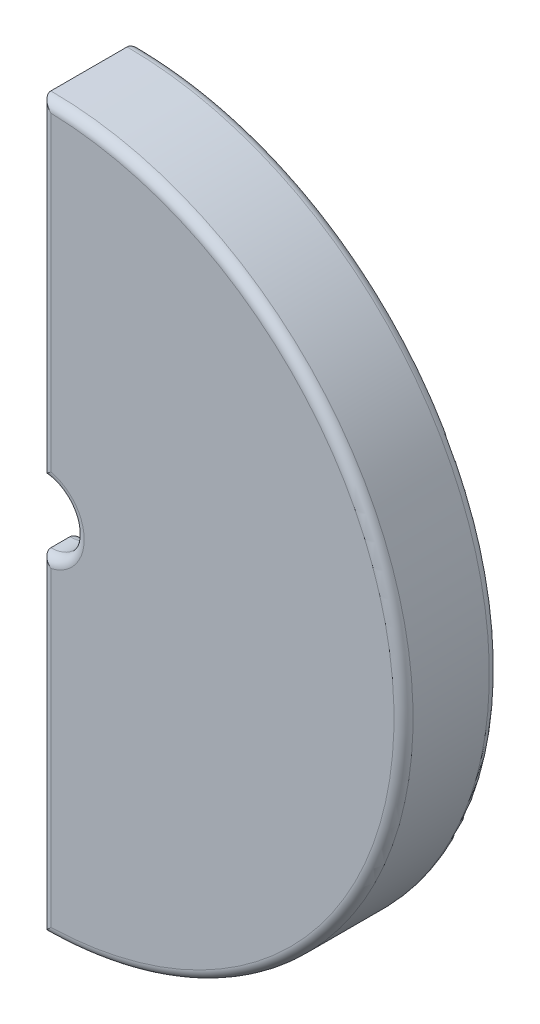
ISO-10303-21;
HEADER;
FILE_DESCRIPTION(('STEP AP214'),'2;1');
FILE_NAME('part.step','',(''),(''),'','','');
FILE_SCHEMA(('AUTOMOTIVE_DESIGN { 1 0 10303 214 1 1 1 1 }'));
ENDSEC;
DATA;
#1=APPLICATION_CONTEXT('core data for automotive mechanical design processes');
#2=APPLICATION_PROTOCOL_DEFINITION('international standard','automotive_design',2000,#1);
#3=PRODUCT_CONTEXT('',#1,'mechanical');
#4=PRODUCT('Part','Part','',(#3));
#5=PRODUCT_RELATED_PRODUCT_CATEGORY('part','',(#4));
#6=PRODUCT_DEFINITION_FORMATION('','',#4);
#7=PRODUCT_DEFINITION_CONTEXT('part definition',#1,'design');
#8=PRODUCT_DEFINITION('design','',#6,#7);
#9=PRODUCT_DEFINITION_SHAPE('','',#8);
#10=(LENGTH_UNIT() NAMED_UNIT(*) SI_UNIT(.MILLI.,.METRE.));
#11=(NAMED_UNIT(*) PLANE_ANGLE_UNIT() SI_UNIT($,.RADIAN.));
#12=(NAMED_UNIT(*) SI_UNIT($,.STERADIAN.) SOLID_ANGLE_UNIT());
#13=UNCERTAINTY_MEASURE_WITH_UNIT(LENGTH_MEASURE(1.E-05),#10,'distance_accuracy_value','');
#14=(GEOMETRIC_REPRESENTATION_CONTEXT(3) GLOBAL_UNCERTAINTY_ASSIGNED_CONTEXT((#13)) GLOBAL_UNIT_ASSIGNED_CONTEXT((#10,
#11,#12)) REPRESENTATION_CONTEXT('',''));
#15=CARTESIAN_POINT('',(0.,0.,0.));
#16=DIRECTION('',(0.,0.,1.));
#17=DIRECTION('',(1.,0.,0.));
#18=AXIS2_PLACEMENT_3D('',#15,#16,#17);
#19=CARTESIAN_POINT('',(0.,0.,2.5));
#20=DIRECTION('',(0.,0.,-1.));
#21=DIRECTION('',(-1.,0.,0.));
#22=AXIS2_PLACEMENT_3D('',#19,#20,#21);
#23=CYLINDRICAL_SURFACE('',#22,1.75);
#24=DIRECTION('',(0.,0.,-1.));
#25=VECTOR('',#24,1.);
#26=CARTESIAN_POINT('',(0.,-1.75,2.5));
#27=LINE('',#26,#25);
#28=CARTESIAN_POINT('',(0.,-1.75,2.));
#29=VERTEX_POINT('',#28);
#30=CARTESIAN_POINT('',(0.,-1.75,1.));
#31=VERTEX_POINT('',#30);
#32=EDGE_CURVE('E147',#29,#31,#27,.T.);
#33=ORIENTED_EDGE('',*,*,#32,.F.);
#34=CARTESIAN_POINT('',(0.,0.,2.));
#35=DIRECTION('',(0.,0.,1.));
#36=DIRECTION('',(1.,0.,0.));
#37=AXIS2_PLACEMENT_3D('',#34,#35,#36);
#38=CIRCLE('',#37,1.75);
#39=CARTESIAN_POINT('',(0.,1.75,2.));
#40=VERTEX_POINT('',#39);
#41=EDGE_CURVE('E142',#29,#40,#38,.T.);
#42=ORIENTED_EDGE('',*,*,#41,.T.);
#43=DIRECTION('',(0.,0.,-1.));
#44=VECTOR('',#43,1.);
#45=CARTESIAN_POINT('',(0.,1.75,2.5));
#46=LINE('',#45,#44);
#47=CARTESIAN_POINT('',(0.,1.75,1.));
#48=VERTEX_POINT('',#47);
#49=EDGE_CURVE('E144',#40,#48,#46,.T.);
#50=ORIENTED_EDGE('',*,*,#49,.T.);
#51=CARTESIAN_POINT('',(0.,0.,1.));
#52=DIRECTION('',(0.,0.,-1.));
#53=DIRECTION('',(-1.,0.,0.));
#54=AXIS2_PLACEMENT_3D('',#51,#52,#53);
#55=CIRCLE('',#54,1.75);
#56=EDGE_CURVE('E153',#48,#31,#55,.T.);
#57=ORIENTED_EDGE('',*,*,#56,.T.);
#58=EDGE_LOOP('',(#33,#42,#50,#57));
#59=FACE_BOUND('',#58,.T.);
#60=ADVANCED_FACE('F31',(#59),#23,.F.);
#61=CARTESIAN_POINT('',(0.,-1.75,2.5));
#62=DIRECTION('',(1.,0.,0.));
#63=DIRECTION('',(0.,0.,-1.));
#64=AXIS2_PLACEMENT_3D('',#61,#62,#63);
#65=PLANE('',#64);
#66=DIRECTION('',(0.,0.,-1.));
#67=VECTOR('',#66,1.);
#68=CARTESIAN_POINT('',(0.,-19.,2.5));
#69=LINE('',#68,#67);
#70=CARTESIAN_POINT('',(0.,-19.,2.));
#71=VERTEX_POINT('',#70);
#72=CARTESIAN_POINT('',(0.,-19.,-2.));
#73=VERTEX_POINT('',#72);
#74=EDGE_CURVE('E369',#71,#73,#69,.T.);
#75=ORIENTED_EDGE('',*,*,#74,.F.);
#76=DIRECTION('',(0.,-1.,0.));
#77=VECTOR('',#76,1.);
#78=CARTESIAN_POINT('',(0.,-1.75,2.));
#79=LINE('',#78,#77);
#80=EDGE_CURVE('E415',#71,#29,#79,.F.);
#81=ORIENTED_EDGE('',*,*,#80,.T.);
#82=ORIENTED_EDGE('',*,*,#32,.T.);
#83=DIRECTION('',(0.,1.,0.));
#84=VECTOR('',#83,1.);
#85=CARTESIAN_POINT('',(0.,-4.5,1.));
#86=LINE('',#85,#84);
#87=CARTESIAN_POINT('',(0.,-3.96862696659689,1.));
#88=VERTEX_POINT('',#87);
#89=EDGE_CURVE('E413',#31,#88,#86,.F.);
#90=ORIENTED_EDGE('',*,*,#89,.T.);
#91=CARTESIAN_POINT('',(0.522779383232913,-3.7971648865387,0.471280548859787));
#92=CARTESIAN_POINT('',(0.,-3.80506267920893,0.448784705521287));
#93=CARTESIAN_POINT('',(0.,-3.63170871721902,0.942561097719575));
#94=CARTESIAN_POINT('',(0.518791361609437,-3.82471952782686,0.480786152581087));
#95=CARTESIAN_POINT('',(0.,-3.82976577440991,0.461917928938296));
#96=CARTESIAN_POINT('',(0.,-3.68571923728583,0.96157230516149));
#97=CARTESIAN_POINT('',(0.514870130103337,-3.85306188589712,0.48796665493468));
#98=CARTESIAN_POINT('',(0.,-3.85614104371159,0.472970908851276));
#99=CARTESIAN_POINT('',(0.,-3.7413494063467,0.975933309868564));
#100=CARTESIAN_POINT('',(0.507248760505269,-3.9104882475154,0.497571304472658));
#101=CARTESIAN_POINT('',(0.,-3.91099547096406,0.490207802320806));
#102=CARTESIAN_POINT('',(0.,-3.85419568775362,0.995142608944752));
#103=CARTESIAN_POINT('',(0.503548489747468,-3.93957179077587,0.499998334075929));
#104=CARTESIAN_POINT('',(0.,-3.93947146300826,0.496436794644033));
#105=CARTESIAN_POINT('',(0.,-3.91141081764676,0.999996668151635));
#106=CARTESIAN_POINT('',(0.496471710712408,-3.99751674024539,0.500001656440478));
#107=CARTESIAN_POINT('',(0.,-3.99741206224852,0.503517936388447));
#108=CARTESIAN_POINT('',(0.,-4.02551740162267,1.00000331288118));
#109=CARTESIAN_POINT('',(0.493093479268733,-4.02637846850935,0.49760548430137));
#110=CARTESIAN_POINT('',(0.,-4.0268803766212,0.504439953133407));
#111=CARTESIAN_POINT('',(0.,-4.0824088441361,0.995210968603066));
#112=CARTESIAN_POINT('',(0.486685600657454,-4.08323422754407,0.488081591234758));
#113=CARTESIAN_POINT('',(0.,-4.08586434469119,0.5007950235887));
#114=CARTESIAN_POINT('',(0.,-4.1945720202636,0.976163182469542));
#115=CARTESIAN_POINT('',(0.483655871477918,-4.111228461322,0.480954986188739));
#116=CARTESIAN_POINT('',(0.,-4.11540131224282,0.496262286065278));
#117=CARTESIAN_POINT('',(0.,-4.24984413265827,0.961909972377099));
#118=CARTESIAN_POINT('',(0.477974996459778,-4.16556163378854,0.462160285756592));
#119=CARTESIAN_POINT('',(0.,-4.17343301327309,0.481742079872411));
#120=CARTESIAN_POINT('',(0.,-4.35719040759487,0.924320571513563));
#121=CARTESIAN_POINT('',(0.475323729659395,-4.19190109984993,0.450493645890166));
#122=CARTESIAN_POINT('',(0.,-4.20195591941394,0.471780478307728));
#123=CARTESIAN_POINT('',(0.,-4.40926558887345,0.900987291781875));
#124=CARTESIAN_POINT('',(0.470410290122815,-4.24222189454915,0.422919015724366));
#125=CARTESIAN_POINT('',(0.,-4.25694905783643,0.446647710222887));
#126=CARTESIAN_POINT('',(0.,-4.50880526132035,0.845838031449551));
#127=CARTESIAN_POINT('',(0.468148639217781,-4.26620004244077,0.407005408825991));
#128=CARTESIAN_POINT('',(0.,-4.28344771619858,0.431483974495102));
#129=CARTESIAN_POINT('',(0.,-4.55626353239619,0.814010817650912));
#130=CARTESIAN_POINT('',(0.464035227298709,-4.31095278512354,0.371482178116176));
#131=CARTESIAN_POINT('',(0.,-4.3332380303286,0.396512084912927));
#132=CARTESIAN_POINT('',(0.,-4.64487492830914,0.742964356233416));
#133=CARTESIAN_POINT('',(0.462181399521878,-4.33174336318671,0.351892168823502));
#134=CARTESIAN_POINT('',(0.,-4.35657571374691,0.376733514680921));
#135=CARTESIAN_POINT('',(0.,-4.68605950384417,0.70378433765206));
#136=CARTESIAN_POINT('',(0.458868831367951,-4.36967263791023,0.309514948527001));
#137=CARTESIAN_POINT('',(0.,-4.39935130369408,0.33313753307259));
#138=CARTESIAN_POINT('',(0.,-4.7612167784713,0.619029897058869));
#139=CARTESIAN_POINT('',(0.457410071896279,-4.38681151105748,0.286727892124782));
#140=CARTESIAN_POINT('',(0.,-4.41881724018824,0.309316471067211));
#141=CARTESIAN_POINT('',(0.,-4.79518982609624,0.57345578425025));
#142=CARTESIAN_POINT('',(0.454891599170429,-4.41686210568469,0.238734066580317));
#143=CARTESIAN_POINT('',(0.,-4.45305055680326,0.258570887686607));
#144=CARTESIAN_POINT('',(0.,-4.85476905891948,0.47746813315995));
#145=CARTESIAN_POINT('',(0.453829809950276,-4.429795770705,0.213540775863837));
#146=CARTESIAN_POINT('',(0.,-4.46786496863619,0.231652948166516));
#147=CARTESIAN_POINT('',(0.,-4.88041867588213,0.427081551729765));
#148=CARTESIAN_POINT('',(0.452092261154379,-4.4511726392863,0.161386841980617));
#149=CARTESIAN_POINT('',(0.,-4.49238826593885,0.175558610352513));
#150=CARTESIAN_POINT('',(0.,-4.92281793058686,0.322773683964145));
#151=CARTESIAN_POINT('',(0.451415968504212,-4.45962204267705,0.134428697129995));
#152=CARTESIAN_POINT('',(0.,-4.50212085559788,0.146369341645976));
#153=CARTESIAN_POINT('',(0.,-4.93957985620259,0.268857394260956));
#154=CARTESIAN_POINT('',(0.450446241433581,-4.47179026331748,0.0795869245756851));
#155=CARTESIAN_POINT('',(0.,-4.51614042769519,0.0867986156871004));
#156=CARTESIAN_POINT('',(0.,-4.96372045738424,0.159173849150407));
#157=CARTESIAN_POINT('',(0.450151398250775,-4.47552648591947,0.0517070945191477));
#158=CARTESIAN_POINT('',(0.,-4.52045700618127,0.056402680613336));
#159=CARTESIAN_POINT('',(0.,-4.97113365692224,0.10341418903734));
#160=CARTESIAN_POINT('',(0.449938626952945,-4.47822066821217,-0.00428496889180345));
#161=CARTESIAN_POINT('',(0.,-4.52356732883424,-0.00466707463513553));
#162=CARTESIAN_POINT('',(0.,-4.97647925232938,-0.00856993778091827));
#163=CARTESIAN_POINT('',(0.45002077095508,-4.47717771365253,-0.032397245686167));
#164=CARTESIAN_POINT('',(0.,-4.52236215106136,-0.0353618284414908));
#165=CARTESIAN_POINT('',(0.,-4.97440983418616,-0.0647944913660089));
#166=CARTESIAN_POINT('',(0.450561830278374,-4.47034201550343,-0.0879812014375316));
#167=CARTESIAN_POINT('',(0.,-4.51447411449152,-0.0959170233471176));
#168=CARTESIAN_POINT('',(0.,-4.96084732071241,-0.175962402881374));
#169=CARTESIAN_POINT('',(0.45101988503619,-4.4645601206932,-0.115454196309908));
#170=CARTESIAN_POINT('',(0.,-4.50779837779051,-0.125799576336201));
#171=CARTESIAN_POINT('',(0.,-4.94937574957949,-0.230908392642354));
#172=CARTESIAN_POINT('',(0.452314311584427,-4.44844740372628,-0.169076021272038));
#173=CARTESIAN_POINT('',(0.,-4.48926941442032,-0.183844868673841));
#174=CARTESIAN_POINT('',(0.,-4.9174128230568,-0.338152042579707));
#175=CARTESIAN_POINT('',(0.453150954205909,-4.43811332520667,-0.19522388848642));
#176=CARTESIAN_POINT('',(0.,-4.47739994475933,-0.212024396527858));
#177=CARTESIAN_POINT('',(0.,-4.89691501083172,-0.390447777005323));
#178=CARTESIAN_POINT('',(0.454177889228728,-4.42560099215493,-0.2203138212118));
#179=CARTESIAN_POINT('',(0.,-4.46308494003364,-0.238809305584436));
#180=CARTESIAN_POINT('',(0.,-4.87210088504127,-0.4406276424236));
#181=(BOUNDED_SURFACE() B_SPLINE_SURFACE(3,2,((#91,#92,#93),(#94,#95,#96),(#97,#98,#99),(#100,
#101,#102),(#103,#104,#105),(#106,#107,#108),(#109,#110,#111),(#112,#113,#114),(#115,#116,#117),
(#118,#119,#120),(#121,#122,#123),(#124,#125,#126),(#127,#128,#129),(#130,#131,#132),(#133,#134,
#135),(#136,#137,#138),(#139,#140,#141),(#142,#143,#144),(#145,#146,#147),(#148,#149,#150),
(#151,#152,#153),(#154,#155,#156),(#157,#158,#159),(#160,#161,#162),(#163,#164,#165),(#166,#167,
#168),(#169,#170,#171),(#172,#173,#174),(#175,#176,#177),(#178,#179,#180)),.UNSPECIFIED.,.F.,
.F.,.F.) B_SPLINE_SURFACE_WITH_KNOTS((4,2,2,2,2,2,2,2,2,2,2,2,2,2,4),(3,3),(0.,
0.171552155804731,0.343000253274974,0.513472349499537,0.683904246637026,0.854281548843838,
1.02488530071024,1.19460346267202,1.3643134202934,1.53312303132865,1.70169863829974,
1.86964987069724,2.03763323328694,2.20523310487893,2.37295306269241),(0.,1.),
.UNSPECIFIED.) GEOMETRIC_REPRESENTATION_ITEM() RATIONAL_B_SPLINE_SURFACE(((1.,0.690811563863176,
1.),(1.,0.693698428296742,1.),(1.,0.696518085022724,1.),(1.,0.701967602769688,1.),(1.,
0.704597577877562,1.),(1.,0.70960170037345,1.),(1.,0.711977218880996,1.),(1.,0.716463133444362,
1.),(1.,0.718573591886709,1.),(1.,0.722515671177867,1.),(1.,0.724347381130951,1.),(1.,
0.727731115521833,1.),(1.,0.729282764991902,1.),(1.,0.73209749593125,1.),(1.,0.733362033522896,
1.),(1.,0.735617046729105,1.),(1.,0.736607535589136,1.),(1.,0.738315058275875,1.),(1.,
0.739033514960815,1.),(1.,0.740208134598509,1.),(1.,0.740664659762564,1.),(1.,0.7413190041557,
1.),(1.,0.741517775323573,1.),(1.,0.7416612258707,1.),(1.,0.741605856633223,1.),(1.,
0.741240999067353,1.),(1.,0.740932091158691,1.),(1.,0.740057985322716,1.),(1.,0.739492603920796,
1.),(1.,0.738797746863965,1.))) REPRESENTATION_ITEM('') SURFACE());
#182=CARTESIAN_POINT('',(0.,-4.87210088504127,-0.4406276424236));
#183=CARTESIAN_POINT('',(0.,-4.89691501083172,-0.390447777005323));
#184=CARTESIAN_POINT('',(0.,-4.9174128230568,-0.338152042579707));
#185=CARTESIAN_POINT('',(0.,-4.94937574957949,-0.230908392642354));
#186=CARTESIAN_POINT('',(0.,-4.96084732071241,-0.175962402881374));
#187=CARTESIAN_POINT('',(0.,-4.97440983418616,-0.0647944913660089));
#188=CARTESIAN_POINT('',(0.,-4.97647925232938,-0.00856993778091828));
#189=CARTESIAN_POINT('',(0.,-4.97113365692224,0.10341418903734));
#190=CARTESIAN_POINT('',(0.,-4.96372045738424,0.159173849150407));
#191=CARTESIAN_POINT('',(0.,-4.93957985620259,0.268857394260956));
#192=CARTESIAN_POINT('',(0.,-4.92281793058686,0.322773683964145));
#193=CARTESIAN_POINT('',(0.,-4.88041867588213,0.427081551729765));
#194=CARTESIAN_POINT('',(0.,-4.85476905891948,0.47746813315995));
#195=CARTESIAN_POINT('',(0.,-4.79518982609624,0.57345578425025));
#196=CARTESIAN_POINT('',(0.,-4.7612167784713,0.619029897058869));
#197=CARTESIAN_POINT('',(0.,-4.68605950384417,0.70378433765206));
#198=CARTESIAN_POINT('',(0.,-4.64487492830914,0.742964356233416));
#199=CARTESIAN_POINT('',(0.,-4.55626353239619,0.814010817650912));
#200=CARTESIAN_POINT('',(0.,-4.50880526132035,0.845838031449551));
#201=CARTESIAN_POINT('',(0.,-4.40926558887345,0.900987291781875));
#202=CARTESIAN_POINT('',(0.,-4.35719040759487,0.924320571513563));
#203=CARTESIAN_POINT('',(0.,-4.24984413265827,0.961909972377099));
#204=CARTESIAN_POINT('',(0.,-4.1945720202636,0.976163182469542));
#205=CARTESIAN_POINT('',(0.,-4.0824088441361,0.995210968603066));
#206=CARTESIAN_POINT('',(0.,-4.02551740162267,1.00000331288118));
#207=CARTESIAN_POINT('',(0.,-3.91141081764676,0.999996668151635));
#208=CARTESIAN_POINT('',(0.,-3.85419568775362,0.995142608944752));
#209=CARTESIAN_POINT('',(0.,-3.7413494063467,0.975933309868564));
#210=CARTESIAN_POINT('',(0.,-3.68571923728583,0.96157230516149));
#211=CARTESIAN_POINT('',(0.,-3.63170871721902,0.942561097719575));
#212=B_SPLINE_CURVE_WITH_KNOTS('',3,(#182,#183,#184,#185,#186,#187,#188,#189,#190,#191,#192,
#193,#194,#195,#196,#197,#198,#199,#200,#201,#202,#203,#204,#205,#206,#207,#208,#209,#210,#211),
.UNSPECIFIED.,.F.,.F.,(4,2,2,2,2,2,2,2,2,2,2,2,2,2,4),(0.,0.167719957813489,0.335319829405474,
0.503303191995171,0.67125442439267,0.839830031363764,1.00863964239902,1.1783496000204,
1.34806776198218,1.51867151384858,1.68904881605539,1.85948071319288,2.02995280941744,
2.20140090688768,2.37295306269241),.UNSPECIFIED.);
#213=CARTESIAN_POINT('',(0.,-4.9749371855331,0.));
#214=VERTEX_POINT('',#213);
#215=EDGE_CURVE('E407',#214,#88,#212,.T.);
#216=ORIENTED_EDGE('',*,*,#215,.F.);
#217=DIRECTION('',(0.,0.,-1.));
#218=VECTOR('',#217,1.);
#219=CARTESIAN_POINT('',(0.,-4.9749371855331,2.5));
#220=LINE('',#219,#218);
#221=CARTESIAN_POINT('',(0.,-4.9749371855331,-2.));
#222=VERTEX_POINT('',#221);
#223=EDGE_CURVE('E405',#214,#222,#220,.T.);
#224=ORIENTED_EDGE('',*,*,#223,.T.);
#225=DIRECTION('',(0.,-1.,0.));
#226=VECTOR('',#225,1.);
#227=CARTESIAN_POINT('',(0.,-1.75,-2.));
#228=LINE('',#227,#226);
#229=EDGE_CURVE('E400',#222,#73,#228,.T.);
#230=ORIENTED_EDGE('',*,*,#229,.T.);
#231=EDGE_LOOP('',(#75,#81,#82,#90,#216,#224,#230));
#232=FACE_BOUND('',#231,.T.);
#233=ADVANCED_FACE('F267',(#232),#65,.F.);
#234=CARTESIAN_POINT('',(0.,0.,2.5));
#235=DIRECTION('',(0.,0.,-1.));
#236=DIRECTION('',(-1.,0.,0.));
#237=AXIS2_PLACEMENT_3D('',#234,#235,#236);
#238=CYLINDRICAL_SURFACE('',#237,19.);
#239=DIRECTION('',(0.,0.,-1.));
#240=VECTOR('',#239,1.);
#241=CARTESIAN_POINT('',(0.,19.,2.5));
#242=LINE('',#241,#240);
#243=CARTESIAN_POINT('',(0.,19.,2.));
#244=VERTEX_POINT('',#243);
#245=CARTESIAN_POINT('',(0.,19.,-2.));
#246=VERTEX_POINT('',#245);
#247=EDGE_CURVE('E164',#244,#246,#242,.T.);
#248=ORIENTED_EDGE('',*,*,#247,.F.);
#249=CARTESIAN_POINT('',(0.,0.,2.));
#250=DIRECTION('',(0.,0.,1.));
#251=DIRECTION('',(1.,0.,0.));
#252=AXIS2_PLACEMENT_3D('',#249,#250,#251);
#253=CIRCLE('',#252,19.);
#254=EDGE_CURVE('E364',#244,#71,#253,.F.);
#255=ORIENTED_EDGE('',*,*,#254,.T.);
#256=ORIENTED_EDGE('',*,*,#74,.T.);
#257=CARTESIAN_POINT('',(0.,0.,-2.));
#258=DIRECTION('',(0.,0.,1.));
#259=DIRECTION('',(1.,0.,0.));
#260=AXIS2_PLACEMENT_3D('',#257,#258,#259);
#261=CIRCLE('',#260,19.);
#262=EDGE_CURVE('E367',#73,#246,#261,.T.);
#263=ORIENTED_EDGE('',*,*,#262,.T.);
#264=EDGE_LOOP('',(#248,#255,#256,#263));
#265=FACE_BOUND('',#264,.T.);
#266=ADVANCED_FACE('F337',(#265),#238,.T.);
#267=CARTESIAN_POINT('',(0.,1.75,2.5));
#268=DIRECTION('',(1.,0.,0.));
#269=DIRECTION('',(0.,0.,-1.));
#270=AXIS2_PLACEMENT_3D('',#267,#268,#269);
#271=PLANE('',#270);
#272=ORIENTED_EDGE('',*,*,#49,.F.);
#273=DIRECTION('',(0.,-1.,0.));
#274=VECTOR('',#273,1.);
#275=CARTESIAN_POINT('',(0.,19.,2.));
#276=LINE('',#275,#274);
#277=EDGE_CURVE('E160',#40,#244,#276,.F.);
#278=ORIENTED_EDGE('',*,*,#277,.T.);
#279=ORIENTED_EDGE('',*,*,#247,.T.);
#280=DIRECTION('',(0.,-1.,0.));
#281=VECTOR('',#280,1.);
#282=CARTESIAN_POINT('',(0.,1.75,-2.));
#283=LINE('',#282,#281);
#284=CARTESIAN_POINT('',(0.,4.9749371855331,-2.));
#285=VERTEX_POINT('',#284);
#286=EDGE_CURVE('E373',#246,#285,#283,.T.);
#287=ORIENTED_EDGE('',*,*,#286,.T.);
#288=DIRECTION('',(0.,0.,-1.));
#289=VECTOR('',#288,1.);
#290=CARTESIAN_POINT('',(0.,4.9749371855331,2.5));
#291=LINE('',#290,#289);
#292=CARTESIAN_POINT('',(0.,4.9749371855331,0.));
#293=VERTEX_POINT('',#292);
#294=EDGE_CURVE('E350',#285,#293,#291,.F.);
#295=ORIENTED_EDGE('',*,*,#294,.T.);
#296=CARTESIAN_POINT('',(0.452255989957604,4.44918803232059,-0.164644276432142));
#297=CARTESIAN_POINT('',(0.,4.49012885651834,-0.178995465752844));
#298=CARTESIAN_POINT('',(0.,4.91888237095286,-0.329288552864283));
#299=CARTESIAN_POINT('',(0.45150292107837,4.45854385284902,-0.138245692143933));
#300=CARTESIAN_POINT('',(0.,4.50088342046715,-0.150525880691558));
#301=CARTESIAN_POINT('',(0.,4.93744114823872,-0.276491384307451));
#302=CARTESIAN_POINT('',(0.450938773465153,4.46560863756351,-0.111057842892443));
#303=CARTESIAN_POINT('',(0.,4.50902079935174,-0.121009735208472));
#304=CARTESIAN_POINT('',(0.,4.95145666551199,-0.222115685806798));
#305=CARTESIAN_POINT('',(0.450187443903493,4.47505583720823,-0.0559131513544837));
#306=CARTESIAN_POINT('',(0.,4.51990701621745,-0.0610053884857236));
#307=CARTESIAN_POINT('',(0.,4.97019948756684,-0.111826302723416));
#308=CARTESIAN_POINT('',(0.449999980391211,4.47744174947,-0.0279568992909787));
#309=CARTESIAN_POINT('',(0.,4.52266728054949,-0.0304980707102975));
#310=CARTESIAN_POINT('',(0.,4.97493372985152,-0.0559137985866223));
#311=CARTESIAN_POINT('',(0.450000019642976,4.477445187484,0.0280056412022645));
#312=CARTESIAN_POINT('',(0.,4.52267306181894,0.0305512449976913));
#313=CARTESIAN_POINT('',(0.,4.97494064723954,0.0560112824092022));
#314=CARTESIAN_POINT('',(0.450188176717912,4.47505439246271,0.0560119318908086));
#315=CARTESIAN_POINT('',(0.,4.51990895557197,0.0611140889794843));
#316=CARTESIAN_POINT('',(0.,4.97019681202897,0.112023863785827));
#317=CARTESIAN_POINT('',(0.450941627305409,4.46556490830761,0.111222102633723));
#318=CARTESIAN_POINT('',(0.,4.50896674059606,0.121187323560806));
#319=CARTESIAN_POINT('',(0.,4.95136971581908,0.222444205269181));
#320=CARTESIAN_POINT('',(0.451506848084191,4.4584671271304,0.138426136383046));
#321=CARTESIAN_POINT('',(0.,4.50078219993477,0.150717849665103));
#322=CARTESIAN_POINT('',(0.,4.9372882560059,0.276852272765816));
#323=CARTESIAN_POINT('',(0.453016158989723,4.43977234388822,0.191248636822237));
#324=CARTESIAN_POINT('',(0.,4.47930378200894,0.207729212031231));
#325=CARTESIAN_POINT('',(0.,4.90020554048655,0.38249727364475));
#326=CARTESIAN_POINT('',(0.453959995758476,4.42817835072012,0.216868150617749));
#327=CARTESIAN_POINT('',(0.,4.46599879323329,0.235228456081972));
#328=CARTESIAN_POINT('',(0.,4.87721024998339,0.433736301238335));
#329=CARTESIAN_POINT('',(0.456231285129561,4.40080328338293,0.265853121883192));
#330=CARTESIAN_POINT('',(0.,4.43474038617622,0.287327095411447));
#331=CARTESIAN_POINT('',(0.,4.82292841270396,0.531706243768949));
#332=CARTESIAN_POINT('',(0.457559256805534,4.38501654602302,0.289215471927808));
#333=CARTESIAN_POINT('',(0.,4.41675992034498,0.311934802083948));
#334=CARTESIAN_POINT('',(0.,4.79163065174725,0.578430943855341));
#335=CARTESIAN_POINT('',(0.460603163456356,4.34968953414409,0.333019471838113));
#336=CARTESIAN_POINT('',(0.,4.3767840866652,0.357434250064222));
#337=CARTESIAN_POINT('',(0.,4.72161655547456,0.666038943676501));
#338=CARTESIAN_POINT('',(0.462319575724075,4.33014464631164,0.353457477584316));
#339=CARTESIAN_POINT('',(0.,4.35475798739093,0.378327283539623));
#340=CARTESIAN_POINT('',(0.,4.6828911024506,0.706914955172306));
#341=CARTESIAN_POINT('',(0.466140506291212,4.28786530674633,0.390812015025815));
#342=CARTESIAN_POINT('',(0.,4.3075012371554,0.415698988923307));
#343=CARTESIAN_POINT('',(0.,4.59915571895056,0.781624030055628));
#344=CARTESIAN_POINT('',(0.468245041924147,4.26513071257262,0.407728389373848));
#345=CARTESIAN_POINT('',(0.,4.28224135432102,0.432175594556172));
#346=CARTESIAN_POINT('',(0.,4.55414550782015,0.815456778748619));
#347=CARTESIAN_POINT('',(0.472851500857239,4.21697605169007,0.437658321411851));
#348=CARTESIAN_POINT('',(0.,4.22928234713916,0.460298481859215));
#349=CARTESIAN_POINT('',(0.,4.45885834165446,0.875316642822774));
#350=CARTESIAN_POINT('',(0.475355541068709,4.19154193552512,0.450649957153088));
#351=CARTESIAN_POINT('',(0.,4.20154079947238,0.471906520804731));
#352=CARTESIAN_POINT('',(0.,4.40855384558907,0.901299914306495));
#353=CARTESIAN_POINT('',(0.480737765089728,4.13883890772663,0.472238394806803));
#354=CARTESIAN_POINT('',(0.,4.14478403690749,0.489844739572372));
#355=CARTESIAN_POINT('',(0.,4.30438325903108,0.944476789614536));
#356=CARTESIAN_POINT('',(0.483615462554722,4.11157240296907,0.480840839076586));
#357=CARTESIAN_POINT('',(0.,4.11574182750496,0.496161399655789));
#358=CARTESIAN_POINT('',(0.,4.25052184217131,0.961681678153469));
#359=CARTESIAN_POINT('',(0.489745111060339,4.05573967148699,0.493492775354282));
#360=CARTESIAN_POINT('',(0.,4.05719559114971,0.503476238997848));
#361=CARTESIAN_POINT('',(0.,4.14031737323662,0.986985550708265));
#362=CARTESIAN_POINT('',(0.492999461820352,4.02716590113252,0.497511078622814));
#363=CARTESIAN_POINT('',(0.,4.027667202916,0.504408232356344));
#364=CARTESIAN_POINT('',(0.,4.08396000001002,0.995022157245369));
#365=CARTESIAN_POINT('',(0.499824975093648,3.9696795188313,0.500791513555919));
#366=CARTESIAN_POINT('',(0.,3.96939252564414,0.500995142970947));
#367=CARTESIAN_POINT('',(0.,3.97068201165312,1.00158302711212));
#368=CARTESIAN_POINT('',(0.503396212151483,3.9407668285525,0.50005252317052));
#369=CARTESIAN_POINT('',(0.,3.94063141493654,0.496611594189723));
#370=CARTESIAN_POINT('',(0.,3.91376126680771,1.00010504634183));
#371=CARTESIAN_POINT('',(0.510810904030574,3.8832558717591,0.493821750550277));
#372=CARTESIAN_POINT('',(0.,3.8847607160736,0.482887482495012));
#373=CARTESIAN_POINT('',(0.,3.80066174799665,0.987643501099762));
#374=CARTESIAN_POINT('',(0.514655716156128,3.85466012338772,0.488304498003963));
#375=CARTESIAN_POINT('',(0.,3.857658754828,0.473478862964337));
#376=CARTESIAN_POINT('',(0.,3.74448859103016,0.976608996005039));
#377=CARTESIAN_POINT('',(0.522496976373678,3.79872045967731,0.472662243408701));
#378=CARTESIAN_POINT('',(0.,3.80609058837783,0.45031342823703));
#379=CARTESIAN_POINT('',(0.,3.63473399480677,0.945324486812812));
#380=CARTESIAN_POINT('',(0.526493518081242,3.77137734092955,0.462534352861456));
#381=CARTESIAN_POINT('',(0.,3.78163734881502,0.43651348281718));
#382=CARTESIAN_POINT('',(0.,3.58115420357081,0.925068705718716));
#383=CARTESIAN_POINT('',(0.530511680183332,3.74506850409,0.450194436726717));
#384=CARTESIAN_POINT('',(0.,3.75906670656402,0.420936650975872));
#385=CARTESIAN_POINT('',(0.,3.52967582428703,0.900388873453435));
#386=(BOUNDED_SURFACE() B_SPLINE_SURFACE(3,2,((#296,#297,#298),(#299,#300,#301),(#302,#303,
#304),(#305,#306,#307),(#308,#309,#310),(#311,#312,#313),(#314,#315,#316),(#317,#318,#319),
(#320,#321,#322),(#323,#324,#325),(#326,#327,#328),(#329,#330,#331),(#332,#333,#334),(#335,#336,
#337),(#338,#339,#340),(#341,#342,#343),(#344,#345,#346),(#347,#348,#349),(#350,#351,#352),
(#353,#354,#355),(#356,#357,#358),(#359,#360,#361),(#362,#363,#364),(#365,#366,#367),(#368,#369,
#370),(#371,#372,#373),(#374,#375,#376),(#377,#378,#379),(#380,#381,#382),(#383,#384,#385)),
.UNSPECIFIED.,.F.,.F.,.F.) B_SPLINE_SURFACE_WITH_KNOTS((4,2,2,2,2,2,2,2,2,2,2,2,2,2,4),(3,3),
(0.,0.167670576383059,0.335215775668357,0.503053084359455,0.670858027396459,0.838550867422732,
1.00647137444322,1.17459934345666,1.34273482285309,1.51179277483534,1.68063284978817,
1.85061492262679,2.02063708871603,2.19157116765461,2.36261248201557),(0.,1.),
.UNSPECIFIED.) GEOMETRIC_REPRESENTATION_ITEM() RATIONAL_B_SPLINE_SURFACE(((1.,0.740097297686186,
1.),(1.,0.740605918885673,1.),(1.,0.740986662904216,1.),(1.,0.741493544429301,1.),(1.,
0.741619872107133,1.),(1.,0.741619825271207,1.),(1.,0.741493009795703,1.),(1.,0.740984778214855,
1.),(1.,0.740603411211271,1.),(1.,0.739583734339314,1.),(1.,0.738945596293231,1.),(1.,
0.737407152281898,1.),(1.,0.736506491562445,1.),(1.,0.734437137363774,1.),(1.,0.733268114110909,
1.),(1.,0.730658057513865,1.),(1.,0.729217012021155,1.),(1.,0.726051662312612,1.),(1.,
0.724325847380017,1.),(1.,0.720600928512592,1.),(1.,0.718602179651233,1.),(1.,0.714324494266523,
1.),(1.,0.712043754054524,1.),(1.,0.707234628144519,1.),(1.,0.704706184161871,1.),(1.,
0.699425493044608,1.),(1.,0.696672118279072,1.),(1.,0.691021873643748,1.),(1.,0.688124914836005,
1.),(1.,0.685192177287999,1.))) REPRESENTATION_ITEM('') SURFACE());
#387=CARTESIAN_POINT('',(0.,3.52967582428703,0.900388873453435));
#388=CARTESIAN_POINT('',(0.,3.58115420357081,0.925068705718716));
#389=CARTESIAN_POINT('',(0.,3.63473399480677,0.945324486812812));
#390=CARTESIAN_POINT('',(0.,3.74448859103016,0.976608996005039));
#391=CARTESIAN_POINT('',(0.,3.80066174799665,0.987643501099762));
#392=CARTESIAN_POINT('',(0.,3.91376126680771,1.00010504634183));
#393=CARTESIAN_POINT('',(0.,3.97068201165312,1.00158302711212));
#394=CARTESIAN_POINT('',(0.,4.08396000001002,0.995022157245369));
#395=CARTESIAN_POINT('',(0.,4.14031737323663,0.986985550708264));
#396=CARTESIAN_POINT('',(0.,4.25052184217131,0.961681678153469));
#397=CARTESIAN_POINT('',(0.,4.30438325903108,0.944476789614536));
#398=CARTESIAN_POINT('',(0.,4.40855384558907,0.901299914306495));
#399=CARTESIAN_POINT('',(0.,4.45885834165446,0.875316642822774));
#400=CARTESIAN_POINT('',(0.,4.55414550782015,0.815456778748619));
#401=CARTESIAN_POINT('',(0.,4.59915571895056,0.781624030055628));
#402=CARTESIAN_POINT('',(0.,4.6828911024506,0.706914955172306));
#403=CARTESIAN_POINT('',(0.,4.72161655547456,0.666038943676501));
#404=CARTESIAN_POINT('',(0.,4.79163065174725,0.578430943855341));
#405=CARTESIAN_POINT('',(0.,4.82292841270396,0.531706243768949));
#406=CARTESIAN_POINT('',(0.,4.87721024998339,0.433736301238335));
#407=CARTESIAN_POINT('',(0.,4.90020554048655,0.38249727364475));
#408=CARTESIAN_POINT('',(0.,4.9372882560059,0.276852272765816));
#409=CARTESIAN_POINT('',(0.,4.95136971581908,0.222444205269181));
#410=CARTESIAN_POINT('',(0.,4.97019681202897,0.112023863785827));
#411=CARTESIAN_POINT('',(0.,4.97494064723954,0.0560112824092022));
#412=CARTESIAN_POINT('',(0.,4.97493372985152,-0.0559137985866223));
#413=CARTESIAN_POINT('',(0.,4.97019948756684,-0.111826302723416));
#414=CARTESIAN_POINT('',(0.,4.95145666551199,-0.222115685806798));
#415=CARTESIAN_POINT('',(0.,4.93744114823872,-0.276491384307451));
#416=CARTESIAN_POINT('',(0.,4.91888237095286,-0.329288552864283));
#417=B_SPLINE_CURVE_WITH_KNOTS('',3,(#387,#388,#389,#390,#391,#392,#393,#394,#395,#396,#397,
#398,#399,#400,#401,#402,#403,#404,#405,#406,#407,#408,#409,#410,#411,#412,#413,#414,#415,#416),
.UNSPECIFIED.,.F.,.F.,(4,2,2,2,2,2,2,2,2,2,2,2,2,2,4),(0.,0.171041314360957,0.341975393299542,
0.511997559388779,0.681979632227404,0.850819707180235,1.01987765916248,1.18801313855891,
1.35614110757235,1.52406161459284,1.69175445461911,1.85955939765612,2.02739670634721,
2.19494190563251,2.36261248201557),.UNSPECIFIED.);
#418=CARTESIAN_POINT('',(0.,3.96862696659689,1.));
#419=VERTEX_POINT('',#418);
#420=EDGE_CURVE('E344',#419,#293,#417,.T.);
#421=ORIENTED_EDGE('',*,*,#420,.F.);
#422=DIRECTION('',(0.,1.,0.));
#423=VECTOR('',#422,1.);
#424=CARTESIAN_POINT('',(0.,1.75,1.));
#425=LINE('',#424,#423);
#426=EDGE_CURVE('E163',#419,#48,#425,.F.);
#427=ORIENTED_EDGE('',*,*,#426,.T.);
#428=EDGE_LOOP('',(#272,#278,#279,#287,#295,#421,#427));
#429=FACE_BOUND('',#428,.T.);
#430=ADVANCED_FACE('F158',(#429),#271,.F.);
#431=CARTESIAN_POINT('',(0.,0.,2.5));
#432=DIRECTION('',(0.,0.,1.));
#433=DIRECTION('',(1.,0.,0.));
#434=AXIS2_PLACEMENT_3D('',#431,#432,#433);
#435=PLANE('',#434);
#436=CARTESIAN_POINT('',(0.,0.,2.5));
#437=DIRECTION('',(0.,0.,1.));
#438=DIRECTION('',(1.,0.,0.));
#439=AXIS2_PLACEMENT_3D('',#436,#437,#438);
#440=CIRCLE('',#439,18.5);
#441=CARTESIAN_POINT('',(0.5,-18.4932420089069,2.5));
#442=VERTEX_POINT('',#441);
#443=CARTESIAN_POINT('',(0.5,18.4932420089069,2.5));
#444=VERTEX_POINT('',#443);
#445=EDGE_CURVE('E420',#442,#444,#440,.T.);
#446=ORIENTED_EDGE('',*,*,#445,.T.);
#447=DIRECTION('',(0.,-1.,0.));
#448=VECTOR('',#447,1.);
#449=CARTESIAN_POINT('',(0.5,1.75,2.5));
#450=LINE('',#449,#448);
#451=CARTESIAN_POINT('',(0.5,2.19374109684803,2.5));
#452=VERTEX_POINT('',#451);
#453=EDGE_CURVE('E422',#444,#452,#450,.T.);
#454=ORIENTED_EDGE('',*,*,#453,.T.);
#455=CARTESIAN_POINT('',(0.,0.,2.5));
#456=DIRECTION('',(0.,0.,1.));
#457=DIRECTION('',(1.,0.,0.));
#458=AXIS2_PLACEMENT_3D('',#455,#456,#457);
#459=CIRCLE('',#458,2.25);
#460=CARTESIAN_POINT('',(0.5,-2.19374109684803,2.5));
#461=VERTEX_POINT('',#460);
#462=EDGE_CURVE('E178',#452,#461,#459,.F.);
#463=ORIENTED_EDGE('',*,*,#462,.T.);
#464=DIRECTION('',(0.,-1.,0.));
#465=VECTOR('',#464,1.);
#466=CARTESIAN_POINT('',(0.5,-19.,2.5));
#467=LINE('',#466,#465);
#468=EDGE_CURVE('E418',#461,#442,#467,.T.);
#469=ORIENTED_EDGE('',*,*,#468,.T.);
#470=EDGE_LOOP('',(#446,#454,#463,#469));
#471=FACE_BOUND('',#470,.T.);
#472=ADVANCED_FACE('F355',(#471),#435,.T.);
#473=CARTESIAN_POINT('',(0.,0.,-2.5));
#474=DIRECTION('',(0.,0.,1.));
#475=DIRECTION('',(1.,0.,0.));
#476=AXIS2_PLACEMENT_3D('',#473,#474,#475);
#477=PLANE('',#476);
#478=DIRECTION('',(0.,-1.,0.));
#479=VECTOR('',#478,1.);
#480=CARTESIAN_POINT('',(0.5,0.,-2.5));
#481=LINE('',#480,#479);
#482=CARTESIAN_POINT('',(0.5,4.9749371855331,-2.5));
#483=VERTEX_POINT('',#482);
#484=CARTESIAN_POINT('',(0.5,18.4932420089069,-2.5));
#485=VERTEX_POINT('',#484);
#486=EDGE_CURVE('E44',#483,#485,#481,.F.);
#487=ORIENTED_EDGE('',*,*,#486,.T.);
#488=CARTESIAN_POINT('',(0.,0.,-2.5));
#489=DIRECTION('',(0.,0.,1.));
#490=DIRECTION('',(1.,0.,0.));
#491=AXIS2_PLACEMENT_3D('',#488,#489,#490);
#492=CIRCLE('',#491,18.5);
#493=CARTESIAN_POINT('',(0.5,-18.4932420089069,-2.5));
#494=VERTEX_POINT('',#493);
#495=EDGE_CURVE('E11',#485,#494,#492,.F.);
#496=ORIENTED_EDGE('',*,*,#495,.T.);
#497=DIRECTION('',(0.,-1.,0.));
#498=VECTOR('',#497,1.);
#499=CARTESIAN_POINT('',(0.5,0.,-2.5));
#500=LINE('',#499,#498);
#501=CARTESIAN_POINT('',(0.5,-4.9749371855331,-2.5));
#502=VERTEX_POINT('',#501);
#503=EDGE_CURVE('E435',#494,#502,#500,.F.);
#504=ORIENTED_EDGE('',*,*,#503,.T.);
#505=CARTESIAN_POINT('',(0.,0.,-2.5));
#506=DIRECTION('',(0.,0.,1.));
#507=DIRECTION('',(1.,0.,0.));
#508=AXIS2_PLACEMENT_3D('',#505,#506,#507);
#509=CIRCLE('',#508,5.);
#510=EDGE_CURVE('E55',#502,#483,#509,.T.);
#511=ORIENTED_EDGE('',*,*,#510,.T.);
#512=EDGE_LOOP('',(#487,#496,#504,#511));
#513=FACE_BOUND('',#512,.T.);
#514=ADVANCED_FACE('F356',(#513),#477,.F.);
#515=CARTESIAN_POINT('',(0.,0.,0.5));
#516=DIRECTION('',(0.,0.,-1.));
#517=DIRECTION('',(-1.,0.,0.));
#518=AXIS2_PLACEMENT_3D('',#515,#516,#517);
#519=PLANE('',#518);
#520=DIRECTION('',(0.,1.,0.));
#521=VECTOR('',#520,1.);
#522=CARTESIAN_POINT('',(0.5,4.5,0.5));
#523=LINE('',#522,#521);
#524=CARTESIAN_POINT('',(0.5,2.19374109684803,0.5));
#525=VERTEX_POINT('',#524);
#526=CARTESIAN_POINT('',(0.5,3.96862696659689,0.5));
#527=VERTEX_POINT('',#526);
#528=EDGE_CURVE('E430',#525,#527,#523,.T.);
#529=ORIENTED_EDGE('',*,*,#528,.T.);
#530=CARTESIAN_POINT('',(0.,0.,0.5));
#531=DIRECTION('',(0.,0.,-1.));
#532=DIRECTION('',(-1.,0.,0.));
#533=AXIS2_PLACEMENT_3D('',#530,#531,#532);
#534=CIRCLE('',#533,4.);
#535=CARTESIAN_POINT('',(0.5,-3.96862696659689,0.5));
#536=VERTEX_POINT('',#535);
#537=EDGE_CURVE('E432',#527,#536,#534,.T.);
#538=ORIENTED_EDGE('',*,*,#537,.T.);
#539=DIRECTION('',(0.,1.,0.));
#540=VECTOR('',#539,1.);
#541=CARTESIAN_POINT('',(0.5,-1.75,0.5));
#542=LINE('',#541,#540);
#543=CARTESIAN_POINT('',(0.5,-2.19374109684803,0.5));
#544=VERTEX_POINT('',#543);
#545=EDGE_CURVE('E152',#536,#544,#542,.T.);
#546=ORIENTED_EDGE('',*,*,#545,.T.);
#547=CARTESIAN_POINT('',(0.,0.,0.5));
#548=DIRECTION('',(0.,0.,-1.));
#549=DIRECTION('',(-1.,0.,0.));
#550=AXIS2_PLACEMENT_3D('',#547,#548,#549);
#551=CIRCLE('',#550,2.25);
#552=EDGE_CURVE('E428',#544,#525,#551,.F.);
#553=ORIENTED_EDGE('',*,*,#552,.T.);
#554=EDGE_LOOP('',(#529,#538,#546,#553));
#555=FACE_BOUND('',#554,.T.);
#556=ADVANCED_FACE('F478',(#555),#519,.T.);
#557=CARTESIAN_POINT('',(0.,0.,0.5));
#558=DIRECTION('',(0.,0.,-1.));
#559=DIRECTION('',(-1.,0.,0.));
#560=AXIS2_PLACEMENT_3D('',#557,#558,#559);
#561=CYLINDRICAL_SURFACE('',#560,4.5);
#562=DIRECTION('',(0.,0.,-1.));
#563=VECTOR('',#562,1.);
#564=CARTESIAN_POINT('',(0.45,-4.47744346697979,0.5));
#565=LINE('',#564,#563);
#566=CARTESIAN_POINT('',(0.45,-4.47744346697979,-2.));
#567=VERTEX_POINT('',#566);
#568=CARTESIAN_POINT('',(0.45,-4.47744346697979,0.));
#569=VERTEX_POINT('',#568);
#570=EDGE_CURVE('E394',#567,#569,#565,.F.);
#571=ORIENTED_EDGE('',*,*,#570,.T.);
#572=CARTESIAN_POINT('',(0.,0.,0.));
#573=DIRECTION('',(0.,0.,-1.));
#574=DIRECTION('',(-1.,0.,0.));
#575=AXIS2_PLACEMENT_3D('',#572,#573,#574);
#576=CIRCLE('',#575,4.5);
#577=CARTESIAN_POINT('',(0.45,4.47744346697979,0.));
#578=VERTEX_POINT('',#577);
#579=EDGE_CURVE('E397',#569,#578,#576,.F.);
#580=ORIENTED_EDGE('',*,*,#579,.T.);
#581=DIRECTION('',(0.,0.,-1.));
#582=VECTOR('',#581,1.);
#583=CARTESIAN_POINT('',(0.45,4.47744346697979,0.5));
#584=LINE('',#583,#582);
#585=CARTESIAN_POINT('',(0.45,4.47744346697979,-2.));
#586=VERTEX_POINT('',#585);
#587=EDGE_CURVE('E381',#578,#586,#584,.T.);
#588=ORIENTED_EDGE('',*,*,#587,.T.);
#589=CARTESIAN_POINT('',(0.,0.,-2.));
#590=DIRECTION('',(0.,0.,1.));
#591=DIRECTION('',(1.,0.,0.));
#592=AXIS2_PLACEMENT_3D('',#589,#590,#591);
#593=CIRCLE('',#592,4.5);
#594=EDGE_CURVE('E175',#586,#567,#593,.F.);
#595=ORIENTED_EDGE('',*,*,#594,.T.);
#596=EDGE_LOOP('',(#571,#580,#588,#595));
#597=FACE_BOUND('',#596,.T.);
#598=ADVANCED_FACE('F323',(#597),#561,.F.);
#599=CARTESIAN_POINT('',(0.5,-1.75,-2.));
#600=DIRECTION('',(0.,-1.,0.));
#601=DIRECTION('',(0.,0.,-1.));
#602=AXIS2_PLACEMENT_3D('',#599,#600,#601);
#603=CYLINDRICAL_SURFACE('',#602,0.5);
#604=CARTESIAN_POINT('',(0.,-19.,-2.));
#605=CARTESIAN_POINT('',(-3.78765681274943E-05,-19.0000372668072,-2.02242104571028));
#606=CARTESIAN_POINT('',(0.00150544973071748,-18.9984945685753,-2.04478588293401));
#607=CARTESIAN_POINT('',(0.00742507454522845,-18.9925738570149,-2.08856145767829));
#608=CARTESIAN_POINT('',(0.0117768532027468,-18.9882203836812,-2.10997875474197));
#609=CARTESIAN_POINT('',(0.0229787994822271,-18.9770080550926,-2.15137030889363));
#610=CARTESIAN_POINT('',(0.0298222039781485,-18.9701559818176,-2.17134829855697));
#611=CARTESIAN_POINT('',(0.0455872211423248,-18.9543596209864,-2.20961399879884));
#612=CARTESIAN_POINT('',(0.0545134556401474,-18.9454106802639,-2.22789782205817));
#613=CARTESIAN_POINT('',(0.0779817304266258,-18.9218625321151,-2.269596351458));
#614=CARTESIAN_POINT('',(0.0933341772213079,-18.9064426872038,-2.29209084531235));
#615=CARTESIAN_POINT('',(0.126354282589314,-18.8732301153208,-2.33330016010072));
#616=CARTESIAN_POINT('',(0.144026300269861,-18.8554329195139,-2.3520076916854));
#617=CARTESIAN_POINT('',(0.188212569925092,-18.8108636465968,-2.39243271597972));
#618=CARTESIAN_POINT('',(0.215478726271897,-18.7833069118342,-2.41245846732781));
#619=CARTESIAN_POINT('',(0.271814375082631,-18.7262348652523,-2.44610524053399));
#620=CARTESIAN_POINT('',(0.30088610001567,-18.6967171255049,-2.45971814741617));
#621=CARTESIAN_POINT('',(0.357696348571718,-18.6388924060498,-2.48019676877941));
#622=CARTESIAN_POINT('',(0.385364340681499,-18.6106680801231,-2.487502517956));
#623=CARTESIAN_POINT('',(0.440999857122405,-18.5537816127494,-2.49730741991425));
#624=CARTESIAN_POINT('',(0.468966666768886,-18.5251204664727,-2.49981621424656));
#625=CARTESIAN_POINT('',(0.49792010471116,-18.4953788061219,-2.4999967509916));
#626=CARTESIAN_POINT('',(0.498960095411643,-18.4943104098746,-2.49999999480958));
#627=CARTESIAN_POINT('',(0.5,-18.4932420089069,-2.5));
#628=B_SPLINE_CURVE_WITH_KNOTS('',3,(#604,#605,#606,#607,#608,#609,#610,#611,#612,#613,#614,
#615,#616,#617,#618,#619,#620,#621,#622,#623,#624,#625,#626,#627),.UNSPECIFIED.,.F.,.F.,(4,2,2,
2,2,2,2,2,2,2,2,4),(0.,0.0670680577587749,0.133558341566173,0.199869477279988,0.266329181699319,
0.359699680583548,0.453248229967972,0.583443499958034,0.713803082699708,0.834090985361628,
0.954136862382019,0.958609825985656),.UNSPECIFIED.);
#629=EDGE_CURVE('E305',#73,#494,#628,.T.);
#630=ORIENTED_EDGE('',*,*,#629,.F.);
#631=ORIENTED_EDGE('',*,*,#229,.F.);
#632=CARTESIAN_POINT('',(0.5,-4.9749371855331,-2.));
#633=DIRECTION('',(0.,1.,0.));
#634=DIRECTION('',(0.,0.,1.));
#635=AXIS2_PLACEMENT_3D('',#632,#633,#634);
#636=CIRCLE('',#635,0.5);
#637=EDGE_CURVE('E442',#502,#222,#636,.T.);
#638=ORIENTED_EDGE('',*,*,#637,.F.);
#639=ORIENTED_EDGE('',*,*,#503,.F.);
#640=EDGE_LOOP('',(#630,#631,#638,#639));
#641=FACE_BOUND('',#640,.T.);
#642=ADVANCED_FACE('F318',(#641),#603,.T.);
#643=CARTESIAN_POINT('',(0.5,0.,1.));
#644=DIRECTION('',(0.,-1.,0.));
#645=DIRECTION('',(0.,0.,-1.));
#646=AXIS2_PLACEMENT_3D('',#643,#644,#645);
#647=CYLINDRICAL_SURFACE('',#646,0.5);
#648=CARTESIAN_POINT('',(0.5,-3.96862696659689,1.));
#649=DIRECTION('',(0.,-1.,0.));
#650=DIRECTION('',(0.,0.,-1.));
#651=AXIS2_PLACEMENT_3D('',#648,#649,#650);
#652=CIRCLE('',#651,0.5);
#653=EDGE_CURVE('E306',#88,#536,#652,.T.);
#654=ORIENTED_EDGE('',*,*,#653,.F.);
#655=ORIENTED_EDGE('',*,*,#89,.F.);
#656=CARTESIAN_POINT('',(0.,-1.75,1.));
#657=CARTESIAN_POINT('',(-3.78979685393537E-05,-1.7499554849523,0.977285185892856));
#658=CARTESIAN_POINT('',(0.00154508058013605,-1.75154538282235,0.954636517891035));
#659=CARTESIAN_POINT('',(0.00761288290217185,-1.75760061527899,0.910336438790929));
#660=CARTESIAN_POINT('',(0.0120702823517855,-1.76203877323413,0.888677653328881));
#661=CARTESIAN_POINT('',(0.0235396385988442,-1.77339181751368,0.846838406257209));
#662=CARTESIAN_POINT('',(0.0305432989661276,-1.78029865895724,0.826653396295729));
#663=CARTESIAN_POINT('',(0.0467010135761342,-1.79611158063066,0.787961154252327));
#664=CARTESIAN_POINT('',(0.0558605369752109,-1.80502274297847,0.76945835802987));
#665=CARTESIAN_POINT('',(0.0802866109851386,-1.82857689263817,0.726721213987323));
#666=CARTESIAN_POINT('',(0.0964816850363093,-1.84403263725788,0.703465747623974));
#667=CARTESIAN_POINT('',(0.131586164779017,-1.87705254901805,0.660829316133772));
#668=CARTESIAN_POINT('',(0.150500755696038,-1.89462073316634,0.641455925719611));
#669=CARTESIAN_POINT('',(0.196631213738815,-1.93682221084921,0.601027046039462));
#670=CARTESIAN_POINT('',(0.224593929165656,-1.96194751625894,0.581338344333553));
#671=CARTESIAN_POINT('',(0.283015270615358,-2.01338447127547,0.548287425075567));
#672=CARTESIAN_POINT('',(0.313474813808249,-2.03969655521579,0.53492754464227));
#673=CARTESIAN_POINT('',(0.3692811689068,-2.08696357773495,0.516701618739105));
#674=CARTESIAN_POINT('',(0.394305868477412,-2.1078440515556,0.510622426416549));
#675=CARTESIAN_POINT('',(0.444999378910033,-2.14951859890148,0.502373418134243));
#676=CARTESIAN_POINT('',(0.470666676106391,-2.17031276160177,0.500195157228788));
#677=CARTESIAN_POINT('',(0.497639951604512,-2.19185782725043,0.500004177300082));
#678=CARTESIAN_POINT('',(0.498819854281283,-2.19279967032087,0.499999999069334));
#679=CARTESIAN_POINT('',(0.5,-2.19374109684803,0.5));
#680=B_SPLINE_CURVE_WITH_KNOTS('',3,(#656,#657,#658,#659,#660,#661,#662,#663,#664,#665,#666,
#667,#668,#669,#670,#671,#672,#673,#674,#675,#676,#677,#678,#679),.UNSPECIFIED.,.F.,.F.,(4,2,2,
2,2,2,2,2,2,2,2,4),(0.,0.0679290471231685,0.135219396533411,0.202292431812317,0.26953749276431,
0.365844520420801,0.462337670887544,0.588989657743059,0.715688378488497,0.814936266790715,
0.913969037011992,0.918498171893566),.UNSPECIFIED.);
#681=EDGE_CURVE('E297',#544,#31,#680,.F.);
#682=ORIENTED_EDGE('',*,*,#681,.F.);
#683=ORIENTED_EDGE('',*,*,#545,.F.);
#684=EDGE_LOOP('',(#654,#655,#682,#683));
#685=FACE_BOUND('',#684,.T.);
#686=ADVANCED_FACE('F313',(#685),#647,.T.);
#687=CARTESIAN_POINT('',(0.5,-4.9749371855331,0.5));
#688=DIRECTION('',(0.,0.,-1.));
#689=DIRECTION('',(-1.,0.,0.));
#690=AXIS2_PLACEMENT_3D('',#687,#688,#689);
#691=CYLINDRICAL_SURFACE('',#690,0.5);
#692=CARTESIAN_POINT('',(0.5,-4.9749371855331,-2.));
#693=DIRECTION('',(0.,0.,-1.));
#694=DIRECTION('',(0.,1.,0.));
#695=AXIS2_PLACEMENT_3D('',#692,#693,#694);
#696=CIRCLE('',#695,0.5);
#697=EDGE_CURVE('E165',#222,#567,#696,.T.);
#698=ORIENTED_EDGE('',*,*,#697,.F.);
#699=ORIENTED_EDGE('',*,*,#223,.F.);
#700=CARTESIAN_POINT('',(0.5,-4.9749371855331,0.));
#701=DIRECTION('',(0.,0.,1.));
#702=DIRECTION('',(1.,0.,0.));
#703=AXIS2_PLACEMENT_3D('',#700,#701,#702);
#704=CIRCLE('',#703,0.5);
#705=EDGE_CURVE('E444',#569,#214,#704,.T.);
#706=ORIENTED_EDGE('',*,*,#705,.F.);
#707=ORIENTED_EDGE('',*,*,#570,.F.);
#708=EDGE_LOOP('',(#698,#699,#706,#707));
#709=FACE_BOUND('',#708,.T.);
#710=ADVANCED_FACE('F317',(#709),#691,.T.);
#711=CARTESIAN_POINT('',(0.5,-4.9749371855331,-2.));
#712=DIRECTION('',(0.,0.,1.));
#713=DIRECTION('',(1.,0.,0.));
#714=AXIS2_PLACEMENT_3D('',#711,#712,#713);
#715=SPHERICAL_SURFACE('',#714,0.5);
#716=ORIENTED_EDGE('',*,*,#637,.T.);
#717=ORIENTED_EDGE('',*,*,#697,.T.);
#718=CARTESIAN_POINT('',(0.5,-4.9749371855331,-2.));
#719=DIRECTION('',(-0.99498743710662,-0.0999999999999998,0.));
#720=DIRECTION('',(0.0999999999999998,-0.99498743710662,0.));
#721=AXIS2_PLACEMENT_3D('',#718,#719,#720);
#722=CIRCLE('',#721,0.5);
#723=EDGE_CURVE('E391',#502,#567,#722,.F.);
#724=ORIENTED_EDGE('',*,*,#723,.F.);
#725=EDGE_LOOP('',(#716,#717,#724));
#726=FACE_BOUND('',#725,.T.);
#727=ADVANCED_FACE('F325',(#726),#715,.T.);
#728=CARTESIAN_POINT('',(0.,0.,-2.));
#729=DIRECTION('',(0.,0.,1.));
#730=DIRECTION('',(1.,0.,0.));
#731=AXIS2_PLACEMENT_3D('',#728,#729,#730);
#732=TOROIDAL_SURFACE('',#731,18.5,0.5);
#733=ORIENTED_EDGE('',*,*,#629,.T.);
#734=ORIENTED_EDGE('',*,*,#495,.F.);
#735=CARTESIAN_POINT('',(0.,19.,-2.));
#736=CARTESIAN_POINT('',(-3.78765681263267E-05,19.0000372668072,-2.02242104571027));
#737=CARTESIAN_POINT('',(0.00150544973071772,18.9984945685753,-2.04478588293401));
#738=CARTESIAN_POINT('',(0.00742507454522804,18.9925738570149,-2.08856145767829));
#739=CARTESIAN_POINT('',(0.0117768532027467,18.9882203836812,-2.10997875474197));
#740=CARTESIAN_POINT('',(0.0229787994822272,18.9770080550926,-2.15137030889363));
#741=CARTESIAN_POINT('',(0.0298222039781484,18.9701559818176,-2.17134829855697));
#742=CARTESIAN_POINT('',(0.0455872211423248,18.9543596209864,-2.20961399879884));
#743=CARTESIAN_POINT('',(0.0545134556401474,18.9454106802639,-2.22789782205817));
#744=CARTESIAN_POINT('',(0.0779817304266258,18.9218625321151,-2.269596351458));
#745=CARTESIAN_POINT('',(0.0933341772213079,18.9064426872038,-2.29209084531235));
#746=CARTESIAN_POINT('',(0.126354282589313,18.8732301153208,-2.33330016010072));
#747=CARTESIAN_POINT('',(0.144026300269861,18.8554329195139,-2.3520076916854));
#748=CARTESIAN_POINT('',(0.188212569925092,18.8108636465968,-2.39243271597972));
#749=CARTESIAN_POINT('',(0.215478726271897,18.7833069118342,-2.41245846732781));
#750=CARTESIAN_POINT('',(0.271814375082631,18.7262348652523,-2.44610524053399));
#751=CARTESIAN_POINT('',(0.30088610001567,18.6967171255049,-2.45971814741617));
#752=CARTESIAN_POINT('',(0.357696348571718,18.6388924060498,-2.48019676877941));
#753=CARTESIAN_POINT('',(0.385364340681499,18.6106680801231,-2.487502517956));
#754=CARTESIAN_POINT('',(0.440999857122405,18.5537816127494,-2.49730741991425));
#755=CARTESIAN_POINT('',(0.468966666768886,18.5251204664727,-2.49981621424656));
#756=CARTESIAN_POINT('',(0.49792010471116,18.4953788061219,-2.4999967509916));
#757=CARTESIAN_POINT('',(0.498960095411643,18.4943104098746,-2.49999999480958));
#758=CARTESIAN_POINT('',(0.5,18.4932420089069,-2.5));
#759=B_SPLINE_CURVE_WITH_KNOTS('',3,(#735,#736,#737,#738,#739,#740,#741,#742,#743,#744,#745,
#746,#747,#748,#749,#750,#751,#752,#753,#754,#755,#756,#757,#758),.UNSPECIFIED.,.F.,.F.,(4,2,2,
2,2,2,2,2,2,2,2,4),(0.,0.067068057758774,0.133558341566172,0.199869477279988,0.266329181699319,
0.359699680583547,0.453248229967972,0.583443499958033,0.713803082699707,0.834090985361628,
0.954136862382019,0.958609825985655),.UNSPECIFIED.);
#760=EDGE_CURVE('E445',#246,#485,#759,.T.);
#761=ORIENTED_EDGE('',*,*,#760,.F.);
#762=ORIENTED_EDGE('',*,*,#262,.F.);
#763=EDGE_LOOP('',(#733,#734,#761,#762));
#764=FACE_BOUND('',#763,.T.);
#765=ADVANCED_FACE('F291',(#764),#732,.T.);
#766=CARTESIAN_POINT('',(0.,0.,1.));
#767=DIRECTION('',(0.,0.,-1.));
#768=DIRECTION('',(-1.,0.,0.));
#769=AXIS2_PLACEMENT_3D('',#766,#767,#768);
#770=TOROIDAL_SURFACE('',#769,2.25,0.5);
#771=ORIENTED_EDGE('',*,*,#681,.T.);
#772=ORIENTED_EDGE('',*,*,#56,.F.);
#773=CARTESIAN_POINT('',(0.,1.75,1.));
#774=CARTESIAN_POINT('',(-3.78979685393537E-05,1.7499554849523,0.977285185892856));
#775=CARTESIAN_POINT('',(0.00154508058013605,1.75154538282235,0.954636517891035));
#776=CARTESIAN_POINT('',(0.00761288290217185,1.75760061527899,0.910336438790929));
#777=CARTESIAN_POINT('',(0.0120702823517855,1.76203877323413,0.888677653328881));
#778=CARTESIAN_POINT('',(0.0235396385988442,1.77339181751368,0.846838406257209));
#779=CARTESIAN_POINT('',(0.0305432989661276,1.78029865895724,0.826653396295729));
#780=CARTESIAN_POINT('',(0.0467010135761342,1.79611158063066,0.787961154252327));
#781=CARTESIAN_POINT('',(0.0558605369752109,1.80502274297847,0.76945835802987));
#782=CARTESIAN_POINT('',(0.0802866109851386,1.82857689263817,0.726721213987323));
#783=CARTESIAN_POINT('',(0.0964816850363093,1.84403263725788,0.703465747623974));
#784=CARTESIAN_POINT('',(0.131586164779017,1.87705254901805,0.660829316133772));
#785=CARTESIAN_POINT('',(0.150500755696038,1.89462073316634,0.641455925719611));
#786=CARTESIAN_POINT('',(0.196631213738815,1.93682221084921,0.601027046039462));
#787=CARTESIAN_POINT('',(0.224593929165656,1.96194751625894,0.581338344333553));
#788=CARTESIAN_POINT('',(0.283015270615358,2.01338447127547,0.548287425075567));
#789=CARTESIAN_POINT('',(0.313474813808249,2.03969655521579,0.53492754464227));
#790=CARTESIAN_POINT('',(0.3692811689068,2.08696357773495,0.516701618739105));
#791=CARTESIAN_POINT('',(0.394305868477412,2.1078440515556,0.510622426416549));
#792=CARTESIAN_POINT('',(0.444999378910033,2.14951859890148,0.502373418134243));
#793=CARTESIAN_POINT('',(0.470666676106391,2.17031276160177,0.500195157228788));
#794=CARTESIAN_POINT('',(0.497639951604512,2.19185782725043,0.500004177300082));
#795=CARTESIAN_POINT('',(0.498819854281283,2.19279967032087,0.499999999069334));
#796=CARTESIAN_POINT('',(0.5,2.19374109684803,0.5));
#797=B_SPLINE_CURVE_WITH_KNOTS('',3,(#773,#774,#775,#776,#777,#778,#779,#780,#781,#782,#783,
#784,#785,#786,#787,#788,#789,#790,#791,#792,#793,#794,#795,#796),.UNSPECIFIED.,.F.,.F.,(4,2,2,
2,2,2,2,2,2,2,2,4),(0.,0.0679290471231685,0.135219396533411,0.202292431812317,0.26953749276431,
0.365844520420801,0.462337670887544,0.588989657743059,0.715688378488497,0.814936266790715,
0.913969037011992,0.918498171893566),.UNSPECIFIED.);
#798=EDGE_CURVE('E281',#525,#48,#797,.F.);
#799=ORIENTED_EDGE('',*,*,#798,.F.);
#800=ORIENTED_EDGE('',*,*,#552,.F.);
#801=EDGE_LOOP('',(#771,#772,#799,#800));
#802=FACE_BOUND('',#801,.T.);
#803=ADVANCED_FACE('F260',(#802),#770,.T.);
#804=ORIENTED_EDGE('',*,*,#215,.T.);
#805=ORIENTED_EDGE('',*,*,#653,.T.);
#806=CARTESIAN_POINT('',(0.522779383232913,-3.7971648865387,0.471280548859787));
#807=CARTESIAN_POINT('',(0.518791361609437,-3.82471952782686,0.480786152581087));
#808=CARTESIAN_POINT('',(0.514870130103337,-3.85306188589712,0.48796665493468));
#809=CARTESIAN_POINT('',(0.507248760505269,-3.9104882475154,0.497571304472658));
#810=CARTESIAN_POINT('',(0.503548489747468,-3.93957179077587,0.499998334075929));
#811=CARTESIAN_POINT('',(0.496471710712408,-3.99751674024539,0.500001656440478));
#812=CARTESIAN_POINT('',(0.493093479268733,-4.02637846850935,0.49760548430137));
#813=CARTESIAN_POINT('',(0.486685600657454,-4.08323422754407,0.488081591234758));
#814=CARTESIAN_POINT('',(0.483655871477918,-4.111228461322,0.480954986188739));
#815=CARTESIAN_POINT('',(0.477974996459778,-4.16556163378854,0.462160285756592));
#816=CARTESIAN_POINT('',(0.475323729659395,-4.19190109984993,0.450493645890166));
#817=CARTESIAN_POINT('',(0.470410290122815,-4.24222189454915,0.422919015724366));
#818=CARTESIAN_POINT('',(0.468148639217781,-4.26620004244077,0.407005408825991));
#819=CARTESIAN_POINT('',(0.464035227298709,-4.31095278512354,0.371482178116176));
#820=CARTESIAN_POINT('',(0.462181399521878,-4.33174336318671,0.351892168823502));
#821=CARTESIAN_POINT('',(0.458868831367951,-4.36967263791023,0.309514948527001));
#822=CARTESIAN_POINT('',(0.457410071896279,-4.38681151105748,0.286727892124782));
#823=CARTESIAN_POINT('',(0.454891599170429,-4.41686210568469,0.238734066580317));
#824=CARTESIAN_POINT('',(0.453829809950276,-4.429795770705,0.213540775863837));
#825=CARTESIAN_POINT('',(0.452092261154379,-4.4511726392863,0.161386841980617));
#826=CARTESIAN_POINT('',(0.451415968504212,-4.45962204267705,0.134428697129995));
#827=CARTESIAN_POINT('',(0.450446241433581,-4.47179026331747,0.0795869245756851));
#828=CARTESIAN_POINT('',(0.450151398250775,-4.47552648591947,0.0517070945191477));
#829=CARTESIAN_POINT('',(0.449938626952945,-4.47822066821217,-0.00428496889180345));
#830=CARTESIAN_POINT('',(0.45002077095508,-4.47717771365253,-0.032397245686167));
#831=CARTESIAN_POINT('',(0.450561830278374,-4.47034201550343,-0.0879812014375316));
#832=CARTESIAN_POINT('',(0.45101988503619,-4.4645601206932,-0.115454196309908));
#833=CARTESIAN_POINT('',(0.452314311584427,-4.44844740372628,-0.169076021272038));
#834=CARTESIAN_POINT('',(0.453150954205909,-4.43811332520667,-0.19522388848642));
#835=CARTESIAN_POINT('',(0.454177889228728,-4.42560099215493,-0.2203138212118));
#836=B_SPLINE_CURVE_WITH_KNOTS('',3,(#806,#807,#808,#809,#810,#811,#812,#813,#814,#815,#816,
#817,#818,#819,#820,#821,#822,#823,#824,#825,#826,#827,#828,#829,#830,#831,#832,#833,#834,#835),
.UNSPECIFIED.,.F.,.F.,(4,2,2,2,2,2,2,2,2,2,2,2,2,2,4),(0.,0.171552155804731,0.343000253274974,
0.513472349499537,0.683904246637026,0.854281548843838,1.02488530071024,1.19460346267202,
1.3643134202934,1.53312303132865,1.70169863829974,1.86964987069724,2.03763323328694,
2.20523310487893,2.37295306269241),.UNSPECIFIED.);
#837=EDGE_CURVE('E276',#569,#536,#836,.F.);
#838=ORIENTED_EDGE('',*,*,#837,.F.);
#839=ORIENTED_EDGE('',*,*,#705,.T.);
#840=EDGE_LOOP('',(#804,#805,#838,#839));
#841=FACE_BOUND('',#840,.T.);
#842=ADVANCED_FACE('F252',(#841),#181,.T.);
#843=CARTESIAN_POINT('',(0.,0.,-2.));
#844=DIRECTION('',(0.,0.,1.));
#845=DIRECTION('',(1.,0.,0.));
#846=AXIS2_PLACEMENT_3D('',#843,#844,#845);
#847=TOROIDAL_SURFACE('',#846,5.,0.5);
#848=ORIENTED_EDGE('',*,*,#723,.T.);
#849=ORIENTED_EDGE('',*,*,#594,.F.);
#850=CARTESIAN_POINT('',(0.5,4.9749371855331,-2.));
#851=DIRECTION('',(-0.99498743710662,0.0999999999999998,0.));
#852=DIRECTION('',(-0.0999999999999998,-0.99498743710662,0.));
#853=AXIS2_PLACEMENT_3D('',#850,#851,#852);
#854=CIRCLE('',#853,0.5);
#855=EDGE_CURVE('E385',#483,#586,#854,.T.);
#856=ORIENTED_EDGE('',*,*,#855,.F.);
#857=ORIENTED_EDGE('',*,*,#510,.F.);
#858=EDGE_LOOP('',(#848,#849,#856,#857));
#859=FACE_BOUND('',#858,.T.);
#860=ADVANCED_FACE('F259',(#859),#847,.T.);
#861=CARTESIAN_POINT('',(0.5,1.75,-2.));
#862=DIRECTION('',(0.,-1.,0.));
#863=DIRECTION('',(0.,0.,-1.));
#864=AXIS2_PLACEMENT_3D('',#861,#862,#863);
#865=CYLINDRICAL_SURFACE('',#864,0.5);
#866=ORIENTED_EDGE('',*,*,#760,.T.);
#867=ORIENTED_EDGE('',*,*,#486,.F.);
#868=CARTESIAN_POINT('',(0.5,4.9749371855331,-2.));
#869=DIRECTION('',(0.,-1.,0.));
#870=DIRECTION('',(0.,0.,-1.));
#871=AXIS2_PLACEMENT_3D('',#868,#869,#870);
#872=CIRCLE('',#871,0.5);
#873=EDGE_CURVE('E387',#285,#483,#872,.T.);
#874=ORIENTED_EDGE('',*,*,#873,.F.);
#875=ORIENTED_EDGE('',*,*,#286,.F.);
#876=EDGE_LOOP('',(#866,#867,#874,#875));
#877=FACE_BOUND('',#876,.T.);
#878=ADVANCED_FACE('F452',(#877),#865,.T.);
#879=CARTESIAN_POINT('',(0.5,0.,1.));
#880=DIRECTION('',(0.,-1.,0.));
#881=DIRECTION('',(0.,0.,-1.));
#882=AXIS2_PLACEMENT_3D('',#879,#880,#881);
#883=CYLINDRICAL_SURFACE('',#882,0.5);
#884=ORIENTED_EDGE('',*,*,#798,.T.);
#885=ORIENTED_EDGE('',*,*,#426,.F.);
#886=CARTESIAN_POINT('',(0.5,3.96862696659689,1.));
#887=DIRECTION('',(0.,1.,0.));
#888=DIRECTION('',(0.,0.,1.));
#889=AXIS2_PLACEMENT_3D('',#886,#887,#888);
#890=CIRCLE('',#889,0.5);
#891=EDGE_CURVE('E226',#527,#419,#890,.T.);
#892=ORIENTED_EDGE('',*,*,#891,.F.);
#893=ORIENTED_EDGE('',*,*,#528,.F.);
#894=EDGE_LOOP('',(#884,#885,#892,#893));
#895=FACE_BOUND('',#894,.T.);
#896=ADVANCED_FACE('F241',(#895),#883,.T.);
#897=CARTESIAN_POINT('',(0.,0.,0.));
#898=DIRECTION('',(0.,0.,-1.));
#899=DIRECTION('',(-1.,0.,0.));
#900=AXIS2_PLACEMENT_3D('',#897,#898,#899);
#901=TOROIDAL_SURFACE('',#900,4.,0.5);
#902=ORIENTED_EDGE('',*,*,#837,.T.);
#903=ORIENTED_EDGE('',*,*,#537,.F.);
#904=CARTESIAN_POINT('',(0.452255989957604,4.44918803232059,-0.164644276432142));
#905=CARTESIAN_POINT('',(0.45150292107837,4.45854385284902,-0.138245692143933));
#906=CARTESIAN_POINT('',(0.450938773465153,4.46560863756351,-0.111057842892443));
#907=CARTESIAN_POINT('',(0.450187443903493,4.47505583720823,-0.0559131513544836));
#908=CARTESIAN_POINT('',(0.449999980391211,4.47744174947,-0.0279568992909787));
#909=CARTESIAN_POINT('',(0.450000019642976,4.477445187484,0.0280056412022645));
#910=CARTESIAN_POINT('',(0.450188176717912,4.47505439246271,0.0560119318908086));
#911=CARTESIAN_POINT('',(0.450941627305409,4.46556490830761,0.111222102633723));
#912=CARTESIAN_POINT('',(0.451506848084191,4.4584671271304,0.138426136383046));
#913=CARTESIAN_POINT('',(0.453016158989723,4.43977234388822,0.191248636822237));
#914=CARTESIAN_POINT('',(0.453959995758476,4.42817835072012,0.216868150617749));
#915=CARTESIAN_POINT('',(0.456231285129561,4.40080328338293,0.265853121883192));
#916=CARTESIAN_POINT('',(0.457559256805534,4.38501654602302,0.289215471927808));
#917=CARTESIAN_POINT('',(0.460603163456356,4.34968953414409,0.333019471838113));
#918=CARTESIAN_POINT('',(0.462319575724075,4.33014464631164,0.353457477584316));
#919=CARTESIAN_POINT('',(0.466140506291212,4.28786530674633,0.390812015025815));
#920=CARTESIAN_POINT('',(0.468245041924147,4.26513071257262,0.407728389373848));
#921=CARTESIAN_POINT('',(0.472851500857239,4.21697605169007,0.437658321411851));
#922=CARTESIAN_POINT('',(0.475355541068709,4.19154193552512,0.450649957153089));
#923=CARTESIAN_POINT('',(0.480737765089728,4.13883890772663,0.472238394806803));
#924=CARTESIAN_POINT('',(0.483615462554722,4.11157240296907,0.480840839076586));
#925=CARTESIAN_POINT('',(0.489745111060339,4.05573967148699,0.493492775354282));
#926=CARTESIAN_POINT('',(0.492999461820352,4.02716590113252,0.497511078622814));
#927=CARTESIAN_POINT('',(0.499824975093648,3.9696795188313,0.500791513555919));
#928=CARTESIAN_POINT('',(0.503396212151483,3.9407668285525,0.50005252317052));
#929=CARTESIAN_POINT('',(0.510810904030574,3.8832558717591,0.493821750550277));
#930=CARTESIAN_POINT('',(0.514655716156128,3.85466012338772,0.488304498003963));
#931=CARTESIAN_POINT('',(0.522496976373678,3.79872045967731,0.472662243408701));
#932=CARTESIAN_POINT('',(0.526493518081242,3.77137734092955,0.462534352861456));
#933=CARTESIAN_POINT('',(0.530511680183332,3.74506850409,0.450194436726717));
#934=B_SPLINE_CURVE_WITH_KNOTS('',3,(#904,#905,#906,#907,#908,#909,#910,#911,#912,#913,#914,
#915,#916,#917,#918,#919,#920,#921,#922,#923,#924,#925,#926,#927,#928,#929,#930,#931,#932,#933),
.UNSPECIFIED.,.F.,.F.,(4,2,2,2,2,2,2,2,2,2,2,2,2,2,4),(0.,0.167670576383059,0.335215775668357,
0.503053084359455,0.670858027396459,0.838550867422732,1.00647137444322,1.17459934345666,
1.34273482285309,1.51179277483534,1.68063284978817,1.85061492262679,2.02063708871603,
2.19157116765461,2.36261248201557),.UNSPECIFIED.);
#935=EDGE_CURVE('E215',#578,#527,#934,.T.);
#936=ORIENTED_EDGE('',*,*,#935,.F.);
#937=ORIENTED_EDGE('',*,*,#579,.F.);
#938=EDGE_LOOP('',(#902,#903,#936,#937));
#939=FACE_BOUND('',#938,.T.);
#940=ADVANCED_FACE('F237',(#939),#901,.F.);
#941=CARTESIAN_POINT('',(0.5,4.9749371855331,-2.));
#942=DIRECTION('',(0.,0.,1.));
#943=DIRECTION('',(1.,0.,0.));
#944=AXIS2_PLACEMENT_3D('',#941,#942,#943);
#945=SPHERICAL_SURFACE('',#944,0.5);
#946=ORIENTED_EDGE('',*,*,#873,.T.);
#947=ORIENTED_EDGE('',*,*,#855,.T.);
#948=CARTESIAN_POINT('',(0.5,4.9749371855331,-2.));
#949=DIRECTION('',(0.,0.,-1.));
#950=DIRECTION('',(-1.,0.,0.));
#951=AXIS2_PLACEMENT_3D('',#948,#949,#950);
#952=CIRCLE('',#951,0.5);
#953=EDGE_CURVE('E208',#285,#586,#952,.F.);
#954=ORIENTED_EDGE('',*,*,#953,.F.);
#955=EDGE_LOOP('',(#946,#947,#954));
#956=FACE_BOUND('',#955,.T.);
#957=ADVANCED_FACE('F240',(#956),#945,.T.);
#958=ORIENTED_EDGE('',*,*,#891,.T.);
#959=ORIENTED_EDGE('',*,*,#420,.T.);
#960=CARTESIAN_POINT('',(0.5,4.9749371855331,0.));
#961=DIRECTION('',(0.,0.,1.));
#962=DIRECTION('',(1.,0.,0.));
#963=AXIS2_PLACEMENT_3D('',#960,#961,#962);
#964=CIRCLE('',#963,0.5);
#965=EDGE_CURVE('E204',#578,#293,#964,.F.);
#966=ORIENTED_EDGE('',*,*,#965,.F.);
#967=ORIENTED_EDGE('',*,*,#935,.T.);
#968=EDGE_LOOP('',(#958,#959,#966,#967));
#969=FACE_BOUND('',#968,.T.);
#970=ADVANCED_FACE('F243',(#969),#386,.T.);
#971=CARTESIAN_POINT('',(0.5,4.9749371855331,0.5));
#972=DIRECTION('',(0.,0.,-1.));
#973=DIRECTION('',(-1.,0.,0.));
#974=AXIS2_PLACEMENT_3D('',#971,#972,#973);
#975=CYLINDRICAL_SURFACE('',#974,0.5);
#976=ORIENTED_EDGE('',*,*,#953,.T.);
#977=ORIENTED_EDGE('',*,*,#587,.F.);
#978=ORIENTED_EDGE('',*,*,#965,.T.);
#979=ORIENTED_EDGE('',*,*,#294,.F.);
#980=EDGE_LOOP('',(#976,#977,#978,#979));
#981=FACE_BOUND('',#980,.T.);
#982=ADVANCED_FACE('F377',(#981),#975,.T.);
#983=CARTESIAN_POINT('',(0.5,0.,2.));
#984=DIRECTION('',(0.,1.,0.));
#985=DIRECTION('',(0.,0.,1.));
#986=AXIS2_PLACEMENT_3D('',#983,#984,#985);
#987=CYLINDRICAL_SURFACE('',#986,0.5);
#988=CARTESIAN_POINT('',(0.,-1.75,2.));
#989=CARTESIAN_POINT('',(-3.78979685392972E-05,-1.7499554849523,2.02271481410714));
#990=CARTESIAN_POINT('',(0.00154508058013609,-1.75154538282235,2.04536348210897));
#991=CARTESIAN_POINT('',(0.00761288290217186,-1.75760061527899,2.08966356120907));
#992=CARTESIAN_POINT('',(0.0120702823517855,-1.76203877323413,2.11132234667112));
#993=CARTESIAN_POINT('',(0.0235396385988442,-1.77339181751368,2.15316159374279));
#994=CARTESIAN_POINT('',(0.0305432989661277,-1.78029865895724,2.17334660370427));
#995=CARTESIAN_POINT('',(0.0467010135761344,-1.79611158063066,2.21203884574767));
#996=CARTESIAN_POINT('',(0.0558605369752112,-1.80502274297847,2.23054164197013));
#997=CARTESIAN_POINT('',(0.0802866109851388,-1.82857689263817,2.27327878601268));
#998=CARTESIAN_POINT('',(0.0964816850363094,-1.84403263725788,2.29653425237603));
#999=CARTESIAN_POINT('',(0.131586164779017,-1.87705254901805,2.33917068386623));
#1000=CARTESIAN_POINT('',(0.150500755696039,-1.89462073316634,2.35854407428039));
#1001=CARTESIAN_POINT('',(0.196631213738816,-1.93682221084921,2.39897295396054));
#1002=CARTESIAN_POINT('',(0.224593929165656,-1.96194751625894,2.41866165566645));
#1003=CARTESIAN_POINT('',(0.283015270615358,-2.01338447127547,2.45171257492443));
#1004=CARTESIAN_POINT('',(0.313474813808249,-2.03969655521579,2.46507245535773));
#1005=CARTESIAN_POINT('',(0.369281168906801,-2.08696357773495,2.4832983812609));
#1006=CARTESIAN_POINT('',(0.394305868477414,-2.1078440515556,2.48937757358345));
#1007=CARTESIAN_POINT('',(0.444999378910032,-2.14951859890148,2.49762658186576));
#1008=CARTESIAN_POINT('',(0.470666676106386,-2.17031276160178,2.49980484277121));
#1009=CARTESIAN_POINT('',(0.497639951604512,-2.19185782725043,2.49999582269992));
#1010=CARTESIAN_POINT('',(0.498819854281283,-2.19279967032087,2.50000000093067));
#1011=CARTESIAN_POINT('',(0.5,-2.19374109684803,2.5));
#1012=B_SPLINE_CURVE_WITH_KNOTS('',3,(#988,#989,#990,#991,#992,#993,#994,#995,#996,#997,#998,
#999,#1000,#1001,#1002,#1003,#1004,#1005,#1006,#1007,#1008,#1009,#1010,#1011),.UNSPECIFIED.,.F.,
.F.,(4,2,2,2,2,2,2,2,2,2,2,4),(0.,0.0679290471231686,0.135219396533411,0.202292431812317,
0.269537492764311,0.365844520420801,0.462337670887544,0.588989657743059,0.715688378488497,
0.814936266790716,0.913969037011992,0.918498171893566),.UNSPECIFIED.);
#1013=EDGE_CURVE('E181',#29,#461,#1012,.T.);
#1014=ORIENTED_EDGE('',*,*,#1013,.F.);
#1015=ORIENTED_EDGE('',*,*,#80,.F.);
#1016=CARTESIAN_POINT('',(0.,-19.,2.));
#1017=CARTESIAN_POINT('',(-3.78765681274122E-05,-19.0000372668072,2.02242104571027));
#1018=CARTESIAN_POINT('',(0.00150544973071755,-18.9984945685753,2.04478588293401));
#1019=CARTESIAN_POINT('',(0.00742507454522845,-18.9925738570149,2.08856145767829));
#1020=CARTESIAN_POINT('',(0.0117768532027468,-18.9882203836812,2.10997875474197));
#1021=CARTESIAN_POINT('',(0.0229787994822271,-18.9770080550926,2.15137030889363));
#1022=CARTESIAN_POINT('',(0.0298222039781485,-18.9701559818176,2.17134829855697));
#1023=CARTESIAN_POINT('',(0.0455872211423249,-18.9543596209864,2.20961399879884));
#1024=CARTESIAN_POINT('',(0.0545134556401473,-18.9454106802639,2.22789782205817));
#1025=CARTESIAN_POINT('',(0.0779817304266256,-18.9218625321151,2.269596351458));
#1026=CARTESIAN_POINT('',(0.0933341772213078,-18.9064426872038,2.29209084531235));
#1027=CARTESIAN_POINT('',(0.126354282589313,-18.8732301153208,2.33330016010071));
#1028=CARTESIAN_POINT('',(0.144026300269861,-18.8554329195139,2.3520076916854));
#1029=CARTESIAN_POINT('',(0.188212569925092,-18.8108636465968,2.39243271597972));
#1030=CARTESIAN_POINT('',(0.215478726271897,-18.7833069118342,2.41245846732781));
#1031=CARTESIAN_POINT('',(0.271814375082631,-18.7262348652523,2.44610524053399));
#1032=CARTESIAN_POINT('',(0.300886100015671,-18.6967171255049,2.45971814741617));
#1033=CARTESIAN_POINT('',(0.357696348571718,-18.6388924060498,2.48019676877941));
#1034=CARTESIAN_POINT('',(0.385364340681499,-18.6106680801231,2.487502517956));
#1035=CARTESIAN_POINT('',(0.440999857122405,-18.5537816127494,2.49730741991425));
#1036=CARTESIAN_POINT('',(0.468966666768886,-18.5251204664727,2.49981621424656));
#1037=CARTESIAN_POINT('',(0.49792010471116,-18.4953788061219,2.4999967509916));
#1038=CARTESIAN_POINT('',(0.498960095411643,-18.4943104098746,2.49999999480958));
#1039=CARTESIAN_POINT('',(0.5,-18.4932420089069,2.5));
#1040=B_SPLINE_CURVE_WITH_KNOTS('',3,(#1016,#1017,#1018,#1019,#1020,#1021,#1022,#1023,#1024,
#1025,#1026,#1027,#1028,#1029,#1030,#1031,#1032,#1033,#1034,#1035,#1036,#1037,#1038,#1039),
.UNSPECIFIED.,.F.,.F.,(4,2,2,2,2,2,2,2,2,2,2,4),(0.,0.0670680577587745,0.133558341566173,
0.199869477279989,0.266329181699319,0.359699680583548,0.453248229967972,0.583443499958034,
0.713803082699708,0.834090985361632,0.954136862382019,0.958609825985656),.UNSPECIFIED.);
#1041=EDGE_CURVE('E36',#442,#71,#1040,.F.);
#1042=ORIENTED_EDGE('',*,*,#1041,.F.);
#1043=ORIENTED_EDGE('',*,*,#468,.F.);
#1044=EDGE_LOOP('',(#1014,#1015,#1042,#1043));
#1045=FACE_BOUND('',#1044,.T.);
#1046=ADVANCED_FACE('F33',(#1045),#987,.T.);
#1047=CARTESIAN_POINT('',(0.,0.,2.));
#1048=DIRECTION('',(0.,0.,1.));
#1049=DIRECTION('',(1.,0.,0.));
#1050=AXIS2_PLACEMENT_3D('',#1047,#1048,#1049);
#1051=TOROIDAL_SURFACE('',#1050,18.5,0.5);
#1052=ORIENTED_EDGE('',*,*,#1041,.T.);
#1053=ORIENTED_EDGE('',*,*,#254,.F.);
#1054=CARTESIAN_POINT('',(0.,19.,2.));
#1055=CARTESIAN_POINT('',(-3.78765681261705E-05,19.0000372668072,2.02242104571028));
#1056=CARTESIAN_POINT('',(0.00150544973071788,18.9984945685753,2.04478588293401));
#1057=CARTESIAN_POINT('',(0.00742507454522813,18.9925738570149,2.08856145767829));
#1058=CARTESIAN_POINT('',(0.0117768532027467,18.9882203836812,2.10997875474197));
#1059=CARTESIAN_POINT('',(0.0229787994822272,18.9770080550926,2.15137030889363));
#1060=CARTESIAN_POINT('',(0.0298222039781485,18.9701559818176,2.17134829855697));
#1061=CARTESIAN_POINT('',(0.0455872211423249,18.9543596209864,2.20961399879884));
#1062=CARTESIAN_POINT('',(0.0545134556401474,18.9454106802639,2.22789782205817));
#1063=CARTESIAN_POINT('',(0.0779817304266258,18.9218625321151,2.269596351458));
#1064=CARTESIAN_POINT('',(0.0933341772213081,18.9064426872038,2.29209084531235));
#1065=CARTESIAN_POINT('',(0.126354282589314,18.8732301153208,2.33330016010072));
#1066=CARTESIAN_POINT('',(0.144026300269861,18.8554329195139,2.3520076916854));
#1067=CARTESIAN_POINT('',(0.188212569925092,18.8108636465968,2.39243271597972));
#1068=CARTESIAN_POINT('',(0.215478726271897,18.7833069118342,2.41245846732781));
#1069=CARTESIAN_POINT('',(0.271814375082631,18.7262348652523,2.44610524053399));
#1070=CARTESIAN_POINT('',(0.30088610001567,18.6967171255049,2.45971814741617));
#1071=CARTESIAN_POINT('',(0.357696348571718,18.6388924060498,2.48019676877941));
#1072=CARTESIAN_POINT('',(0.385364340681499,18.6106680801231,2.487502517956));
#1073=CARTESIAN_POINT('',(0.440999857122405,18.5537816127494,2.49730741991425));
#1074=CARTESIAN_POINT('',(0.468966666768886,18.5251204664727,2.49981621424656));
#1075=CARTESIAN_POINT('',(0.49792010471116,18.4953788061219,2.4999967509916));
#1076=CARTESIAN_POINT('',(0.498960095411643,18.4943104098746,2.49999999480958));
#1077=CARTESIAN_POINT('',(0.5,18.4932420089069,2.5));
#1078=B_SPLINE_CURVE_WITH_KNOTS('',3,(#1054,#1055,#1056,#1057,#1058,#1059,#1060,#1061,#1062,
#1063,#1064,#1065,#1066,#1067,#1068,#1069,#1070,#1071,#1072,#1073,#1074,#1075,#1076,#1077),
.UNSPECIFIED.,.F.,.F.,(4,2,2,2,2,2,2,2,2,2,2,4),(0.,0.0670680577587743,0.133558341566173,
0.199869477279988,0.266329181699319,0.359699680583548,0.453248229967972,0.583443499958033,
0.713803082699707,0.834090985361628,0.954136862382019,0.958609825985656),.UNSPECIFIED.);
#1079=EDGE_CURVE('E173',#444,#244,#1078,.F.);
#1080=ORIENTED_EDGE('',*,*,#1079,.F.);
#1081=ORIENTED_EDGE('',*,*,#445,.F.);
#1082=EDGE_LOOP('',(#1052,#1053,#1080,#1081));
#1083=FACE_BOUND('',#1082,.T.);
#1084=ADVANCED_FACE('F197',(#1083),#1051,.T.);
#1085=CARTESIAN_POINT('',(0.,0.,2.));
#1086=DIRECTION('',(0.,0.,1.));
#1087=DIRECTION('',(1.,0.,0.));
#1088=AXIS2_PLACEMENT_3D('',#1085,#1086,#1087);
#1089=TOROIDAL_SURFACE('',#1088,2.25,0.5);
#1090=ORIENTED_EDGE('',*,*,#1013,.T.);
#1091=ORIENTED_EDGE('',*,*,#462,.F.);
#1092=CARTESIAN_POINT('',(0.,1.75,2.));
#1093=CARTESIAN_POINT('',(-3.78979685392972E-05,1.7499554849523,2.02271481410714));
#1094=CARTESIAN_POINT('',(0.00154508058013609,1.75154538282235,2.04536348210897));
#1095=CARTESIAN_POINT('',(0.00761288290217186,1.75760061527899,2.08966356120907));
#1096=CARTESIAN_POINT('',(0.0120702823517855,1.76203877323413,2.11132234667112));
#1097=CARTESIAN_POINT('',(0.0235396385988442,1.77339181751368,2.15316159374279));
#1098=CARTESIAN_POINT('',(0.0305432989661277,1.78029865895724,2.17334660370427));
#1099=CARTESIAN_POINT('',(0.0467010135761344,1.79611158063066,2.21203884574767));
#1100=CARTESIAN_POINT('',(0.0558605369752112,1.80502274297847,2.23054164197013));
#1101=CARTESIAN_POINT('',(0.0802866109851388,1.82857689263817,2.27327878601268));
#1102=CARTESIAN_POINT('',(0.0964816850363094,1.84403263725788,2.29653425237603));
#1103=CARTESIAN_POINT('',(0.131586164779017,1.87705254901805,2.33917068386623));
#1104=CARTESIAN_POINT('',(0.150500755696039,1.89462073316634,2.35854407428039));
#1105=CARTESIAN_POINT('',(0.196631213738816,1.93682221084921,2.39897295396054));
#1106=CARTESIAN_POINT('',(0.224593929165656,1.96194751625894,2.41866165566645));
#1107=CARTESIAN_POINT('',(0.283015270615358,2.01338447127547,2.45171257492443));
#1108=CARTESIAN_POINT('',(0.313474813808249,2.03969655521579,2.46507245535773));
#1109=CARTESIAN_POINT('',(0.369281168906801,2.08696357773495,2.4832983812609));
#1110=CARTESIAN_POINT('',(0.394305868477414,2.1078440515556,2.48937757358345));
#1111=CARTESIAN_POINT('',(0.444999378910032,2.14951859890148,2.49762658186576));
#1112=CARTESIAN_POINT('',(0.470666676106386,2.17031276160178,2.49980484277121));
#1113=CARTESIAN_POINT('',(0.497639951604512,2.19185782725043,2.49999582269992));
#1114=CARTESIAN_POINT('',(0.498819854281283,2.19279967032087,2.50000000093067));
#1115=CARTESIAN_POINT('',(0.5,2.19374109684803,2.5));
#1116=B_SPLINE_CURVE_WITH_KNOTS('',3,(#1092,#1093,#1094,#1095,#1096,#1097,#1098,#1099,#1100,
#1101,#1102,#1103,#1104,#1105,#1106,#1107,#1108,#1109,#1110,#1111,#1112,#1113,#1114,#1115),
.UNSPECIFIED.,.F.,.F.,(4,2,2,2,2,2,2,2,2,2,2,4),(0.,0.0679290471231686,0.135219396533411,
0.202292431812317,0.269537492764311,0.365844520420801,0.462337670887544,0.588989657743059,
0.715688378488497,0.814936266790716,0.913969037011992,0.918498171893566),.UNSPECIFIED.);
#1117=EDGE_CURVE('E170',#40,#452,#1116,.T.);
#1118=ORIENTED_EDGE('',*,*,#1117,.F.);
#1119=ORIENTED_EDGE('',*,*,#41,.F.);
#1120=EDGE_LOOP('',(#1090,#1091,#1118,#1119));
#1121=FACE_BOUND('',#1120,.T.);
#1122=ADVANCED_FACE('F177',(#1121),#1089,.T.);
#1123=CARTESIAN_POINT('',(0.5,0.,2.));
#1124=DIRECTION('',(0.,1.,0.));
#1125=DIRECTION('',(0.,0.,1.));
#1126=AXIS2_PLACEMENT_3D('',#1123,#1124,#1125);
#1127=CYLINDRICAL_SURFACE('',#1126,0.5);
#1128=ORIENTED_EDGE('',*,*,#1079,.T.);
#1129=ORIENTED_EDGE('',*,*,#277,.F.);
#1130=ORIENTED_EDGE('',*,*,#1117,.T.);
#1131=ORIENTED_EDGE('',*,*,#453,.F.);
#1132=EDGE_LOOP('',(#1128,#1129,#1130,#1131));
#1133=FACE_BOUND('',#1132,.T.);
#1134=ADVANCED_FACE('F168',(#1133),#1127,.T.);
#1135=CLOSED_SHELL('',(#60,#233,#266,#430,#472,#514,#556,#598,#642,#686,#710,#727,#765,#803,
#842,#860,#878,#896,#940,#957,#970,#982,#1046,#1084,#1122,#1134));
#1136=MANIFOLD_SOLID_BREP('B2',#1135);
#1137=ADVANCED_BREP_SHAPE_REPRESENTATION('',(#18,#1136),#14);
#1138=SHAPE_DEFINITION_REPRESENTATION(#9,#1137);
ENDSEC;
END-ISO-10303-21;
